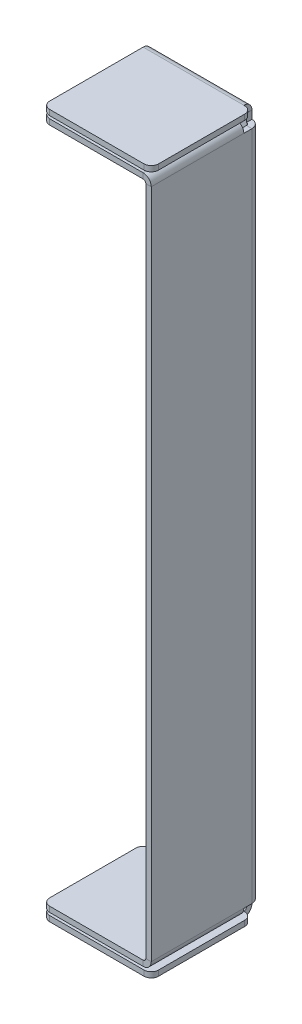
ISO-10303-21;
HEADER;
FILE_DESCRIPTION(('STEP AP214'),'2;1');
FILE_NAME('part.step','',(''),(''),'','','');
FILE_SCHEMA(('AUTOMOTIVE_DESIGN { 1 0 10303 214 1 1 1 1 }'));
ENDSEC;
DATA;
#1=APPLICATION_CONTEXT('core data for automotive mechanical design processes');
#2=APPLICATION_PROTOCOL_DEFINITION('international standard','automotive_design',2000,#1);
#3=PRODUCT_CONTEXT('',#1,'mechanical');
#4=PRODUCT('Part','Part','',(#3));
#5=PRODUCT_RELATED_PRODUCT_CATEGORY('part','',(#4));
#6=PRODUCT_DEFINITION_FORMATION('','',#4);
#7=PRODUCT_DEFINITION_CONTEXT('part definition',#1,'design');
#8=PRODUCT_DEFINITION('design','',#6,#7);
#9=PRODUCT_DEFINITION_SHAPE('','',#8);
#10=(LENGTH_UNIT() NAMED_UNIT(*) SI_UNIT(.MILLI.,.METRE.));
#11=(NAMED_UNIT(*) PLANE_ANGLE_UNIT() SI_UNIT($,.RADIAN.));
#12=(NAMED_UNIT(*) SI_UNIT($,.STERADIAN.) SOLID_ANGLE_UNIT());
#13=UNCERTAINTY_MEASURE_WITH_UNIT(LENGTH_MEASURE(1.E-05),#10,'distance_accuracy_value','');
#14=(GEOMETRIC_REPRESENTATION_CONTEXT(3) GLOBAL_UNCERTAINTY_ASSIGNED_CONTEXT((#13)) GLOBAL_UNIT_ASSIGNED_CONTEXT((#10,
#11,#12)) REPRESENTATION_CONTEXT('',''));
#15=CARTESIAN_POINT('',(0.,0.,0.));
#16=DIRECTION('',(0.,0.,1.));
#17=DIRECTION('',(1.,0.,0.));
#18=AXIS2_PLACEMENT_3D('',#15,#16,#17);
#19=CARTESIAN_POINT('',(12.7634,94.7634,0.7366));
#20=DIRECTION('',(0.,1.,0.));
#21=DIRECTION('',(1.,0.,0.));
#22=AXIS2_PLACEMENT_3D('',#19,#20,#21);
#23=CYLINDRICAL_SURFACE('',#22,2.2366);
#24=DIRECTION('',(0.,1.,0.));
#25=VECTOR('',#24,1.);
#26=CARTESIAN_POINT('',(15.,-94.7634,0.736599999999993));
#27=LINE('',#26,#25);
#28=CARTESIAN_POINT('',(15.,92.5234,0.736599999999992));
#29=VERTEX_POINT('',#28);
#30=CARTESIAN_POINT('',(15.,-92.5234,0.736599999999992));
#31=VERTEX_POINT('',#30);
#32=EDGE_CURVE('E795',#29,#31,#27,.F.);
#33=ORIENTED_EDGE('',*,*,#32,.T.);
#34=CARTESIAN_POINT('',(12.7634,-92.5234,0.7366));
#35=DIRECTION('',(0.,1.,0.));
#36=DIRECTION('',(0.,0.,1.));
#37=AXIS2_PLACEMENT_3D('',#34,#35,#36);
#38=CIRCLE('',#37,2.2366);
#39=CARTESIAN_POINT('',(12.7634,-92.5234,-1.5));
#40=VERTEX_POINT('',#39);
#41=EDGE_CURVE('E456',#31,#40,#38,.T.);
#42=ORIENTED_EDGE('',*,*,#41,.T.);
#43=DIRECTION('',(0.,1.,0.));
#44=VECTOR('',#43,1.);
#45=CARTESIAN_POINT('',(12.7634,94.7634,-1.5));
#46=LINE('',#45,#44);
#47=CARTESIAN_POINT('',(12.7634,92.5234,-1.5));
#48=VERTEX_POINT('',#47);
#49=EDGE_CURVE('E484',#48,#40,#46,.F.);
#50=ORIENTED_EDGE('',*,*,#49,.F.);
#51=CARTESIAN_POINT('',(12.7634,92.5234,0.7366));
#52=DIRECTION('',(0.,-1.,0.));
#53=DIRECTION('',(0.,0.,-1.));
#54=AXIS2_PLACEMENT_3D('',#51,#52,#53);
#55=CIRCLE('',#54,2.2366);
#56=EDGE_CURVE('E827',#48,#29,#55,.T.);
#57=ORIENTED_EDGE('',*,*,#56,.T.);
#58=EDGE_LOOP('',(#33,#42,#50,#57));
#59=FACE_BOUND('',#58,.T.);
#60=ADVANCED_FACE('F141',(#59),#23,.T.);
#61=CARTESIAN_POINT('',(12.7634,94.7634,0.7366));
#62=DIRECTION('',(0.,1.,0.));
#63=DIRECTION('',(1.,0.,0.));
#64=AXIS2_PLACEMENT_3D('',#61,#62,#63);
#65=CYLINDRICAL_SURFACE('',#64,0.7366);
#66=CARTESIAN_POINT('',(12.7634,-92.5234,0.7366));
#67=DIRECTION('',(0.,-1.,0.));
#68=DIRECTION('',(0.,0.,1.));
#69=AXIS2_PLACEMENT_3D('',#66,#67,#68);
#70=CIRCLE('',#69,0.736599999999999);
#71=CARTESIAN_POINT('',(12.7634,-92.5234,0.));
#72=VERTEX_POINT('',#71);
#73=CARTESIAN_POINT('',(13.5,-92.5234,0.736599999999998));
#74=VERTEX_POINT('',#73);
#75=EDGE_CURVE('E457',#72,#74,#70,.T.);
#76=ORIENTED_EDGE('',*,*,#75,.T.);
#77=DIRECTION('',(0.,1.,0.));
#78=VECTOR('',#77,1.);
#79=CARTESIAN_POINT('',(13.5,-94.7634,0.736599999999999));
#80=LINE('',#79,#78);
#81=CARTESIAN_POINT('',(13.5,92.5234,0.736599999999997));
#82=VERTEX_POINT('',#81);
#83=EDGE_CURVE('E790',#74,#82,#80,.T.);
#84=ORIENTED_EDGE('',*,*,#83,.T.);
#85=CARTESIAN_POINT('',(12.7634,92.5234,0.7366));
#86=DIRECTION('',(0.,-1.,0.));
#87=DIRECTION('',(0.,0.,-1.));
#88=AXIS2_PLACEMENT_3D('',#85,#86,#87);
#89=CIRCLE('',#88,0.7366);
#90=CARTESIAN_POINT('',(12.7634,92.5234,0.));
#91=VERTEX_POINT('',#90);
#92=EDGE_CURVE('E480',#91,#82,#89,.T.);
#93=ORIENTED_EDGE('',*,*,#92,.F.);
#94=DIRECTION('',(0.,1.,0.));
#95=VECTOR('',#94,1.);
#96=CARTESIAN_POINT('',(12.7634,94.7634,0.));
#97=LINE('',#96,#95);
#98=EDGE_CURVE('E472',#91,#72,#97,.F.);
#99=ORIENTED_EDGE('',*,*,#98,.T.);
#100=EDGE_LOOP('',(#76,#84,#93,#99));
#101=FACE_BOUND('',#100,.T.);
#102=ADVANCED_FACE('F478',(#101),#65,.F.);
#103=CARTESIAN_POINT('',(15.,-94.7634,0.736600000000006));
#104=DIRECTION('',(1.,0.,0.));
#105=DIRECTION('',(0.,-1.,0.));
#106=AXIS2_PLACEMENT_3D('',#103,#104,#105);
#107=CYLINDRICAL_SURFACE('',#106,2.2366);
#108=DIRECTION('',(1.,0.,0.));
#109=VECTOR('',#108,1.);
#110=CARTESIAN_POINT('',(15.,-94.7634,-1.5));
#111=LINE('',#110,#109);
#112=CARTESIAN_POINT('',(12.76,-94.7634,-1.5));
#113=VERTEX_POINT('',#112);
#114=CARTESIAN_POINT('',(-15.,-94.7634,-1.5));
#115=VERTEX_POINT('',#114);
#116=EDGE_CURVE('E518',#113,#115,#111,.F.);
#117=ORIENTED_EDGE('',*,*,#116,.F.);
#118=CARTESIAN_POINT('',(12.76,-94.7634,0.736600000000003));
#119=DIRECTION('',(-1.,0.,0.));
#120=DIRECTION('',(0.,0.,1.));
#121=AXIS2_PLACEMENT_3D('',#118,#119,#120);
#122=CIRCLE('',#121,2.2366);
#123=CARTESIAN_POINT('',(12.76,-97.,0.736600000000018));
#124=VERTEX_POINT('',#123);
#125=EDGE_CURVE('E1009',#113,#124,#122,.T.);
#126=ORIENTED_EDGE('',*,*,#125,.T.);
#127=DIRECTION('',(1.,0.,0.));
#128=VECTOR('',#127,1.);
#129=CARTESIAN_POINT('',(-15.,-97.,0.736599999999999));
#130=LINE('',#129,#128);
#131=CARTESIAN_POINT('',(-15.,-97.,0.736599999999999));
#132=VERTEX_POINT('',#131);
#133=EDGE_CURVE('E511',#124,#132,#130,.F.);
#134=ORIENTED_EDGE('',*,*,#133,.T.);
#135=CARTESIAN_POINT('',(-15.,-94.7634,0.736600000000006));
#136=DIRECTION('',(1.,0.,0.));
#137=DIRECTION('',(0.,0.,-1.));
#138=AXIS2_PLACEMENT_3D('',#135,#136,#137);
#139=CIRCLE('',#138,2.2366);
#140=EDGE_CURVE('E522',#115,#132,#139,.F.);
#141=ORIENTED_EDGE('',*,*,#140,.F.);
#142=EDGE_LOOP('',(#117,#126,#134,#141));
#143=FACE_BOUND('',#142,.T.);
#144=ADVANCED_FACE('F895',(#143),#107,.T.);
#145=CARTESIAN_POINT('',(15.,-94.7634,0.736600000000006));
#146=DIRECTION('',(1.,0.,0.));
#147=DIRECTION('',(0.,-1.,0.));
#148=AXIS2_PLACEMENT_3D('',#145,#146,#147);
#149=CYLINDRICAL_SURFACE('',#148,0.736600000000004);
#150=CARTESIAN_POINT('',(12.76,-94.7634,0.736600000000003));
#151=DIRECTION('',(-1.,0.,0.));
#152=DIRECTION('',(0.,0.,1.));
#153=AXIS2_PLACEMENT_3D('',#150,#151,#152);
#154=CIRCLE('',#153,0.7366);
#155=CARTESIAN_POINT('',(12.76,-94.7634,0.));
#156=VERTEX_POINT('',#155);
#157=CARTESIAN_POINT('',(12.76,-95.5,0.736600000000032));
#158=VERTEX_POINT('',#157);
#159=EDGE_CURVE('E1101',#156,#158,#154,.T.);
#160=ORIENTED_EDGE('',*,*,#159,.F.);
#161=DIRECTION('',(1.,0.,0.));
#162=VECTOR('',#161,1.);
#163=CARTESIAN_POINT('',(15.,-94.7634,0.));
#164=LINE('',#163,#162);
#165=CARTESIAN_POINT('',(-15.,-94.7634,0.));
#166=VERTEX_POINT('',#165);
#167=EDGE_CURVE('E495',#156,#166,#164,.F.);
#168=ORIENTED_EDGE('',*,*,#167,.T.);
#169=CARTESIAN_POINT('',(-15.,-94.7634,0.736600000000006));
#170=DIRECTION('',(1.,0.,0.));
#171=DIRECTION('',(0.,0.,-1.));
#172=AXIS2_PLACEMENT_3D('',#169,#170,#171);
#173=CIRCLE('',#172,0.736600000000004);
#174=CARTESIAN_POINT('',(-15.,-95.5,0.736600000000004));
#175=VERTEX_POINT('',#174);
#176=EDGE_CURVE('E521',#166,#175,#173,.F.);
#177=ORIENTED_EDGE('',*,*,#176,.T.);
#178=DIRECTION('',(1.,0.,0.));
#179=VECTOR('',#178,1.);
#180=CARTESIAN_POINT('',(-15.,-95.5,0.736600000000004));
#181=LINE('',#180,#179);
#182=EDGE_CURVE('E512',#175,#158,#181,.T.);
#183=ORIENTED_EDGE('',*,*,#182,.T.);
#184=EDGE_LOOP('',(#160,#168,#177,#183));
#185=FACE_BOUND('',#184,.T.);
#186=ADVANCED_FACE('F925',(#185),#149,.F.);
#187=CARTESIAN_POINT('',(12.7634,92.5268,0.7366));
#188=DIRECTION('',(0.,0.,-1.));
#189=DIRECTION('',(0.,1.,0.));
#190=AXIS2_PLACEMENT_3D('',#187,#188,#189);
#191=CYLINDRICAL_SURFACE('',#190,2.2366);
#192=DIRECTION('',(0.,0.,-1.));
#193=VECTOR('',#192,1.);
#194=CARTESIAN_POINT('',(15.,92.5268,0.736599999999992));
#195=LINE('',#194,#193);
#196=CARTESIAN_POINT('',(15.,92.5268,2.97659999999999));
#197=VERTEX_POINT('',#196);
#198=CARTESIAN_POINT('',(15.0000000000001,92.5268,28.5));
#199=VERTEX_POINT('',#198);
#200=EDGE_CURVE('E780',#197,#199,#195,.F.);
#201=ORIENTED_EDGE('',*,*,#200,.F.);
#202=CARTESIAN_POINT('',(12.7634,92.5268,2.9766));
#203=DIRECTION('',(0.,0.,-1.));
#204=DIRECTION('',(-1.,0.,0.));
#205=AXIS2_PLACEMENT_3D('',#202,#203,#204);
#206=CIRCLE('',#205,2.23660000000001);
#207=CARTESIAN_POINT('',(12.7634,94.7634,2.9766));
#208=VERTEX_POINT('',#207);
#209=EDGE_CURVE('E1021',#208,#197,#206,.T.);
#210=ORIENTED_EDGE('',*,*,#209,.F.);
#211=DIRECTION('',(0.,0.,-1.));
#212=VECTOR('',#211,1.);
#213=CARTESIAN_POINT('',(12.7634000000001,94.7634,28.5000000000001));
#214=LINE('',#213,#212);
#215=CARTESIAN_POINT('',(12.7634000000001,94.7634,28.5));
#216=VERTEX_POINT('',#215);
#217=EDGE_CURVE('E770',#208,#216,#214,.F.);
#218=ORIENTED_EDGE('',*,*,#217,.T.);
#219=CARTESIAN_POINT('',(12.7634000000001,92.5268,28.5));
#220=DIRECTION('',(0.,0.,-1.));
#221=DIRECTION('',(-1.,0.,0.));
#222=AXIS2_PLACEMENT_3D('',#219,#220,#221);
#223=CIRCLE('',#222,2.2366);
#224=EDGE_CURVE('E779',#199,#216,#223,.F.);
#225=ORIENTED_EDGE('',*,*,#224,.F.);
#226=EDGE_LOOP('',(#201,#210,#218,#225));
#227=FACE_BOUND('',#226,.T.);
#228=ADVANCED_FACE('F929',(#227),#191,.T.);
#229=CARTESIAN_POINT('',(12.7634,92.5268,0.7366));
#230=DIRECTION('',(0.,0.,-1.));
#231=DIRECTION('',(0.,1.,0.));
#232=AXIS2_PLACEMENT_3D('',#229,#230,#231);
#233=CYLINDRICAL_SURFACE('',#232,0.736600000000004);
#234=CARTESIAN_POINT('',(12.7634,92.5268,2.9766));
#235=DIRECTION('',(0.,0.,-1.));
#236=DIRECTION('',(-1.,0.,0.));
#237=AXIS2_PLACEMENT_3D('',#234,#235,#236);
#238=CIRCLE('',#237,0.736600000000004);
#239=CARTESIAN_POINT('',(12.7634,93.2634,2.9766));
#240=VERTEX_POINT('',#239);
#241=CARTESIAN_POINT('',(13.5,92.5268,2.9766));
#242=VERTEX_POINT('',#241);
#243=EDGE_CURVE('E1017',#240,#242,#238,.T.);
#244=ORIENTED_EDGE('',*,*,#243,.T.);
#245=DIRECTION('',(0.,0.,-1.));
#246=VECTOR('',#245,1.);
#247=CARTESIAN_POINT('',(13.5,92.5268,0.736599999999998));
#248=LINE('',#247,#246);
#249=CARTESIAN_POINT('',(13.5000000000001,92.5268,28.5));
#250=VERTEX_POINT('',#249);
#251=EDGE_CURVE('E753',#242,#250,#248,.F.);
#252=ORIENTED_EDGE('',*,*,#251,.T.);
#253=CARTESIAN_POINT('',(12.7634000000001,92.5268,28.5));
#254=DIRECTION('',(0.,0.,-1.));
#255=DIRECTION('',(-1.,0.,0.));
#256=AXIS2_PLACEMENT_3D('',#253,#254,#255);
#257=CIRCLE('',#256,0.736600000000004);
#258=CARTESIAN_POINT('',(12.7634000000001,93.2634,28.5));
#259=VERTEX_POINT('',#258);
#260=EDGE_CURVE('E784',#250,#259,#257,.F.);
#261=ORIENTED_EDGE('',*,*,#260,.T.);
#262=DIRECTION('',(0.,0.,-1.));
#263=VECTOR('',#262,1.);
#264=CARTESIAN_POINT('',(12.7634000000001,93.2634,28.5000000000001));
#265=LINE('',#264,#263);
#266=EDGE_CURVE('E771',#259,#240,#265,.T.);
#267=ORIENTED_EDGE('',*,*,#266,.T.);
#268=EDGE_LOOP('',(#244,#252,#261,#267));
#269=FACE_BOUND('',#268,.T.);
#270=ADVANCED_FACE('F1127',(#269),#233,.F.);
#271=CARTESIAN_POINT('',(12.7634000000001,-92.5268,28.5));
#272=DIRECTION('',(0.,0.,1.));
#273=DIRECTION('',(0.,-1.,0.));
#274=AXIS2_PLACEMENT_3D('',#271,#272,#273);
#275=CYLINDRICAL_SURFACE('',#274,2.2366);
#276=DIRECTION('',(0.,0.,1.));
#277=VECTOR('',#276,1.);
#278=CARTESIAN_POINT('',(12.7634,-94.7634,0.736600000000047));
#279=LINE('',#278,#277);
#280=CARTESIAN_POINT('',(12.7634000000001,-94.7634,28.5));
#281=VERTEX_POINT('',#280);
#282=CARTESIAN_POINT('',(12.7634,-94.7634,2.9766));
#283=VERTEX_POINT('',#282);
#284=EDGE_CURVE('E734',#281,#283,#279,.F.);
#285=ORIENTED_EDGE('',*,*,#284,.T.);
#286=CARTESIAN_POINT('',(12.7634,-92.5268,2.9766));
#287=DIRECTION('',(0.,0.,-1.));
#288=DIRECTION('',(-1.,0.,0.));
#289=AXIS2_PLACEMENT_3D('',#286,#287,#288);
#290=CIRCLE('',#289,2.23660000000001);
#291=CARTESIAN_POINT('',(15.,-92.5268,2.97659999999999));
#292=VERTEX_POINT('',#291);
#293=EDGE_CURVE('E1008',#292,#283,#290,.T.);
#294=ORIENTED_EDGE('',*,*,#293,.F.);
#295=DIRECTION('',(0.,0.,1.));
#296=VECTOR('',#295,1.);
#297=CARTESIAN_POINT('',(15.0000000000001,-92.5268,28.5));
#298=LINE('',#297,#296);
#299=CARTESIAN_POINT('',(15.0000000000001,-92.5268,28.5));
#300=VERTEX_POINT('',#299);
#301=EDGE_CURVE('E739',#300,#292,#298,.F.);
#302=ORIENTED_EDGE('',*,*,#301,.F.);
#303=CARTESIAN_POINT('',(12.7634000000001,-92.5268,28.5));
#304=DIRECTION('',(0.,0.,1.));
#305=DIRECTION('',(1.,0.,0.));
#306=AXIS2_PLACEMENT_3D('',#303,#304,#305);
#307=CIRCLE('',#306,2.2366);
#308=EDGE_CURVE('E743',#281,#300,#307,.T.);
#309=ORIENTED_EDGE('',*,*,#308,.F.);
#310=EDGE_LOOP('',(#285,#294,#302,#309));
#311=FACE_BOUND('',#310,.T.);
#312=ADVANCED_FACE('F1117',(#311),#275,.T.);
#313=CARTESIAN_POINT('',(12.7634000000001,-92.5268,28.5));
#314=DIRECTION('',(0.,0.,1.));
#315=DIRECTION('',(0.,-1.,0.));
#316=AXIS2_PLACEMENT_3D('',#313,#314,#315);
#317=CYLINDRICAL_SURFACE('',#316,0.736600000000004);
#318=CARTESIAN_POINT('',(12.7634,-92.5268,2.9766));
#319=DIRECTION('',(0.,0.,1.));
#320=DIRECTION('',(1.,0.,0.));
#321=AXIS2_PLACEMENT_3D('',#318,#319,#320);
#322=CIRCLE('',#321,0.736600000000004);
#323=CARTESIAN_POINT('',(13.5,-92.5268,2.9766));
#324=VERTEX_POINT('',#323);
#325=CARTESIAN_POINT('',(12.7634,-93.2634,2.9766));
#326=VERTEX_POINT('',#325);
#327=EDGE_CURVE('E856',#324,#326,#322,.F.);
#328=ORIENTED_EDGE('',*,*,#327,.T.);
#329=DIRECTION('',(0.,0.,1.));
#330=VECTOR('',#329,1.);
#331=CARTESIAN_POINT('',(12.7634,-93.2634,0.736600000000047));
#332=LINE('',#331,#330);
#333=CARTESIAN_POINT('',(12.7634000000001,-93.2634,28.5));
#334=VERTEX_POINT('',#333);
#335=EDGE_CURVE('E697',#326,#334,#332,.T.);
#336=ORIENTED_EDGE('',*,*,#335,.T.);
#337=CARTESIAN_POINT('',(12.7634000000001,-92.5268,28.5));
#338=DIRECTION('',(0.,0.,1.));
#339=DIRECTION('',(1.,0.,0.));
#340=AXIS2_PLACEMENT_3D('',#337,#338,#339);
#341=CIRCLE('',#340,0.736600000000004);
#342=CARTESIAN_POINT('',(13.5000000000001,-92.5268,28.5));
#343=VERTEX_POINT('',#342);
#344=EDGE_CURVE('E714',#334,#343,#341,.T.);
#345=ORIENTED_EDGE('',*,*,#344,.T.);
#346=DIRECTION('',(0.,0.,1.));
#347=VECTOR('',#346,1.);
#348=CARTESIAN_POINT('',(13.5000000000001,-92.5268,28.5));
#349=LINE('',#348,#347);
#350=EDGE_CURVE('E718',#343,#324,#349,.F.);
#351=ORIENTED_EDGE('',*,*,#350,.T.);
#352=EDGE_LOOP('',(#328,#336,#345,#351));
#353=FACE_BOUND('',#352,.T.);
#354=ADVANCED_FACE('F855',(#353),#317,.F.);
#355=CARTESIAN_POINT('',(-15.,94.7634,0.736600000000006));
#356=DIRECTION('',(-1.,0.,0.));
#357=DIRECTION('',(0.,1.,0.));
#358=AXIS2_PLACEMENT_3D('',#355,#356,#357);
#359=CYLINDRICAL_SURFACE('',#358,2.2366);
#360=DIRECTION('',(-1.,0.,0.));
#361=VECTOR('',#360,1.);
#362=CARTESIAN_POINT('',(15.,97.,0.736599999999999));
#363=LINE('',#362,#361);
#364=CARTESIAN_POINT('',(-15.,97.,0.736599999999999));
#365=VERTEX_POINT('',#364);
#366=CARTESIAN_POINT('',(12.76,97.,0.736599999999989));
#367=VERTEX_POINT('',#366);
#368=EDGE_CURVE('E550',#365,#367,#363,.F.);
#369=ORIENTED_EDGE('',*,*,#368,.T.);
#370=CARTESIAN_POINT('',(12.76,94.7634,0.736600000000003));
#371=DIRECTION('',(-1.,0.,0.));
#372=DIRECTION('',(0.,0.,1.));
#373=AXIS2_PLACEMENT_3D('',#370,#371,#372);
#374=CIRCLE('',#373,2.2366);
#375=CARTESIAN_POINT('',(12.76,94.7634,-1.5));
#376=VERTEX_POINT('',#375);
#377=EDGE_CURVE('E844',#367,#376,#374,.T.);
#378=ORIENTED_EDGE('',*,*,#377,.T.);
#379=DIRECTION('',(-1.,0.,0.));
#380=VECTOR('',#379,1.);
#381=CARTESIAN_POINT('',(-15.,94.7634,-1.5));
#382=LINE('',#381,#380);
#383=CARTESIAN_POINT('',(-15.,94.7634,-1.5));
#384=VERTEX_POINT('',#383);
#385=EDGE_CURVE('E558',#384,#376,#382,.F.);
#386=ORIENTED_EDGE('',*,*,#385,.F.);
#387=CARTESIAN_POINT('',(-15.,94.7634,0.736600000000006));
#388=DIRECTION('',(-1.,0.,0.));
#389=DIRECTION('',(0.,0.,1.));
#390=AXIS2_PLACEMENT_3D('',#387,#388,#389);
#391=CIRCLE('',#390,2.2366);
#392=EDGE_CURVE('E562',#365,#384,#391,.T.);
#393=ORIENTED_EDGE('',*,*,#392,.F.);
#394=EDGE_LOOP('',(#369,#378,#386,#393));
#395=FACE_BOUND('',#394,.T.);
#396=ADVANCED_FACE('F954',(#395),#359,.T.);
#397=CARTESIAN_POINT('',(-15.,94.7634,0.736600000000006));
#398=DIRECTION('',(-1.,0.,0.));
#399=DIRECTION('',(0.,1.,0.));
#400=AXIS2_PLACEMENT_3D('',#397,#398,#399);
#401=CYLINDRICAL_SURFACE('',#400,0.736600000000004);
#402=CARTESIAN_POINT('',(12.76,94.7634,0.736600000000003));
#403=DIRECTION('',(1.,0.,0.));
#404=DIRECTION('',(0.,0.,-1.));
#405=AXIS2_PLACEMENT_3D('',#402,#403,#404);
#406=CIRCLE('',#405,0.7366);
#407=CARTESIAN_POINT('',(12.76,95.5,0.736600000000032));
#408=VERTEX_POINT('',#407);
#409=CARTESIAN_POINT('',(12.76,94.7634,0.));
#410=VERTEX_POINT('',#409);
#411=EDGE_CURVE('E841',#408,#410,#406,.F.);
#412=ORIENTED_EDGE('',*,*,#411,.F.);
#413=DIRECTION('',(-1.,0.,0.));
#414=VECTOR('',#413,1.);
#415=CARTESIAN_POINT('',(15.,95.5,0.736600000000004));
#416=LINE('',#415,#414);
#417=CARTESIAN_POINT('',(-15.,95.5,0.736600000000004));
#418=VERTEX_POINT('',#417);
#419=EDGE_CURVE('E531',#408,#418,#416,.T.);
#420=ORIENTED_EDGE('',*,*,#419,.T.);
#421=CARTESIAN_POINT('',(-15.,94.7634,0.736600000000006));
#422=DIRECTION('',(-1.,0.,0.));
#423=DIRECTION('',(0.,0.,1.));
#424=AXIS2_PLACEMENT_3D('',#421,#422,#423);
#425=CIRCLE('',#424,0.736600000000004);
#426=CARTESIAN_POINT('',(-15.,94.7634,0.));
#427=VERTEX_POINT('',#426);
#428=EDGE_CURVE('E535',#418,#427,#425,.T.);
#429=ORIENTED_EDGE('',*,*,#428,.T.);
#430=DIRECTION('',(-1.,0.,0.));
#431=VECTOR('',#430,1.);
#432=CARTESIAN_POINT('',(-15.,94.7634,0.));
#433=LINE('',#432,#431);
#434=EDGE_CURVE('E565',#427,#410,#433,.F.);
#435=ORIENTED_EDGE('',*,*,#434,.T.);
#436=EDGE_LOOP('',(#412,#420,#429,#435));
#437=FACE_BOUND('',#436,.T.);
#438=ADVANCED_FACE('F957',(#437),#401,.F.);
#439=CARTESIAN_POINT('',(15.,0.,0.));
#440=DIRECTION('',(-1.,0.,0.));
#441=DIRECTION('',(0.,0.,1.));
#442=AXIS2_PLACEMENT_3D('',#439,#440,#441);
#443=PLANE('',#442);
#444=ORIENTED_EDGE('',*,*,#301,.T.);
#445=DIRECTION('',(0.,0.,-1.));
#446=VECTOR('',#445,1.);
#447=CARTESIAN_POINT('',(15.,-92.5268,2.97659999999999));
#448=LINE('',#447,#446);
#449=CARTESIAN_POINT('',(15.,-92.5268,0.736599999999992));
#450=VERTEX_POINT('',#449);
#451=EDGE_CURVE('E1031',#292,#450,#448,.T.);
#452=ORIENTED_EDGE('',*,*,#451,.T.);
#453=DIRECTION('',(0.,-1.,0.));
#454=VECTOR('',#453,1.);
#455=CARTESIAN_POINT('',(15.,-92.5234,0.736599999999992));
#456=LINE('',#455,#454);
#457=EDGE_CURVE('E1050',#31,#450,#456,.T.);
#458=ORIENTED_EDGE('',*,*,#457,.F.);
#459=ORIENTED_EDGE('',*,*,#32,.F.);
#460=CARTESIAN_POINT('',(15.,92.5268,0.736599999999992));
#461=VERTEX_POINT('',#460);
#462=EDGE_CURVE('E794',#461,#29,#27,.F.);
#463=ORIENTED_EDGE('',*,*,#462,.F.);
#464=EDGE_CURVE('E776',#461,#197,#195,.F.);
#465=ORIENTED_EDGE('',*,*,#464,.T.);
#466=ORIENTED_EDGE('',*,*,#200,.T.);
#467=DIRECTION('',(0.,-1.,0.));
#468=VECTOR('',#467,1.);
#469=CARTESIAN_POINT('',(15.0000000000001,0.,28.5));
#470=LINE('',#469,#468);
#471=EDGE_CURVE('E482',#199,#300,#470,.T.);
#472=ORIENTED_EDGE('',*,*,#471,.T.);
#473=EDGE_LOOP('',(#444,#452,#458,#459,#463,#465,#466,#472));
#474=FACE_BOUND('',#473,.T.);
#475=ADVANCED_FACE('F961',(#474),#443,.F.);
#476=CARTESIAN_POINT('',(13.5,0.,0.));
#477=DIRECTION('',(-1.,0.,0.));
#478=DIRECTION('',(0.,0.,1.));
#479=AXIS2_PLACEMENT_3D('',#476,#477,#478);
#480=PLANE('',#479);
#481=CARTESIAN_POINT('',(13.5,-92.5268,0.736599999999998));
#482=VERTEX_POINT('',#481);
#483=EDGE_CURVE('E797',#482,#74,#80,.T.);
#484=ORIENTED_EDGE('',*,*,#483,.F.);
#485=DIRECTION('',(0.,0.,1.));
#486=VECTOR('',#485,1.);
#487=CARTESIAN_POINT('',(13.5000000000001,-92.5268,28.5));
#488=LINE('',#487,#486);
#489=EDGE_CURVE('E808',#324,#482,#488,.F.);
#490=ORIENTED_EDGE('',*,*,#489,.F.);
#491=ORIENTED_EDGE('',*,*,#350,.F.);
#492=DIRECTION('',(0.,1.,0.));
#493=VECTOR('',#492,1.);
#494=CARTESIAN_POINT('',(13.5000000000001,-94.7634,28.5));
#495=LINE('',#494,#493);
#496=EDGE_CURVE('E486',#250,#343,#495,.F.);
#497=ORIENTED_EDGE('',*,*,#496,.F.);
#498=ORIENTED_EDGE('',*,*,#251,.F.);
#499=CARTESIAN_POINT('',(13.5,92.5268,0.736599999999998));
#500=VERTEX_POINT('',#499);
#501=EDGE_CURVE('E787',#500,#242,#248,.F.);
#502=ORIENTED_EDGE('',*,*,#501,.F.);
#503=DIRECTION('',(0.,1.,0.));
#504=VECTOR('',#503,1.);
#505=CARTESIAN_POINT('',(13.5,94.7634,0.736600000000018));
#506=LINE('',#505,#504);
#507=EDGE_CURVE('E812',#500,#82,#506,.F.);
#508=ORIENTED_EDGE('',*,*,#507,.T.);
#509=ORIENTED_EDGE('',*,*,#83,.F.);
#510=EDGE_LOOP('',(#484,#490,#491,#497,#498,#502,#508,#509));
#511=FACE_BOUND('',#510,.T.);
#512=ADVANCED_FACE('F806',(#511),#480,.T.);
#513=CARTESIAN_POINT('',(15.0000000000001,-94.7634,28.5));
#514=DIRECTION('',(0.,0.,-1.));
#515=DIRECTION('',(-1.,0.,0.));
#516=AXIS2_PLACEMENT_3D('',#513,#514,#515);
#517=PLANE('',#516);
#518=DIRECTION('',(1.,0.,0.));
#519=VECTOR('',#518,1.);
#520=CARTESIAN_POINT('',(13.5000000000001,-92.5268,28.5));
#521=LINE('',#520,#519);
#522=EDGE_CURVE('E742',#343,#300,#521,.T.);
#523=ORIENTED_EDGE('',*,*,#522,.T.);
#524=ORIENTED_EDGE('',*,*,#471,.F.);
#525=DIRECTION('',(1.,0.,0.));
#526=VECTOR('',#525,1.);
#527=CARTESIAN_POINT('',(13.5000000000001,92.5268,28.5));
#528=LINE('',#527,#526);
#529=EDGE_CURVE('E783',#250,#199,#528,.T.);
#530=ORIENTED_EDGE('',*,*,#529,.F.);
#531=ORIENTED_EDGE('',*,*,#496,.T.);
#532=EDGE_LOOP('',(#523,#524,#530,#531));
#533=FACE_BOUND('',#532,.T.);
#534=ADVANCED_FACE('F898',(#533),#517,.F.);
#535=CARTESIAN_POINT('',(0.,0.,-1.5));
#536=DIRECTION('',(0.,0.,-1.));
#537=DIRECTION('',(-1.,0.,0.));
#538=AXIS2_PLACEMENT_3D('',#535,#536,#537);
#539=PLANE('',#538);
#540=ORIENTED_EDGE('',*,*,#385,.T.);
#541=DIRECTION('',(-1.,0.,0.));
#542=VECTOR('',#541,1.);
#543=CARTESIAN_POINT('',(-15.,94.7634,-1.5));
#544=LINE('',#543,#542);
#545=CARTESIAN_POINT('',(12.7634,94.7634,-1.5));
#546=VERTEX_POINT('',#545);
#547=EDGE_CURVE('E838',#376,#546,#544,.F.);
#548=ORIENTED_EDGE('',*,*,#547,.T.);
#549=EDGE_CURVE('E490',#546,#48,#46,.F.);
#550=ORIENTED_EDGE('',*,*,#549,.T.);
#551=ORIENTED_EDGE('',*,*,#49,.T.);
#552=DIRECTION('',(0.,-1.,0.));
#553=VECTOR('',#552,1.);
#554=CARTESIAN_POINT('',(12.7634,-92.5234,-1.5));
#555=LINE('',#554,#553);
#556=CARTESIAN_POINT('',(12.7634,-94.7634,-1.5));
#557=VERTEX_POINT('',#556);
#558=EDGE_CURVE('E452',#40,#557,#555,.T.);
#559=ORIENTED_EDGE('',*,*,#558,.T.);
#560=EDGE_CURVE('E520',#557,#113,#111,.F.);
#561=ORIENTED_EDGE('',*,*,#560,.T.);
#562=ORIENTED_EDGE('',*,*,#116,.T.);
#563=DIRECTION('',(0.,-1.,0.));
#564=VECTOR('',#563,1.);
#565=CARTESIAN_POINT('',(-15.,-97.,-1.5));
#566=LINE('',#565,#564);
#567=EDGE_CURVE('E573',#384,#115,#566,.T.);
#568=ORIENTED_EDGE('',*,*,#567,.F.);
#569=EDGE_LOOP('',(#540,#548,#550,#551,#559,#561,#562,#568));
#570=FACE_BOUND('',#569,.T.);
#571=ADVANCED_FACE('F967',(#570),#539,.T.);
#572=CARTESIAN_POINT('',(0.,0.,0.));
#573=DIRECTION('',(0.,0.,-1.));
#574=DIRECTION('',(-1.,0.,0.));
#575=AXIS2_PLACEMENT_3D('',#572,#573,#574);
#576=PLANE('',#575);
#577=CARTESIAN_POINT('',(12.7634,94.7634,0.));
#578=VERTEX_POINT('',#577);
#579=EDGE_CURVE('E481',#578,#91,#97,.F.);
#580=ORIENTED_EDGE('',*,*,#579,.F.);
#581=DIRECTION('',(1.,0.,0.));
#582=VECTOR('',#581,1.);
#583=CARTESIAN_POINT('',(12.76,94.7634,0.));
#584=LINE('',#583,#582);
#585=EDGE_CURVE('E832',#410,#578,#584,.T.);
#586=ORIENTED_EDGE('',*,*,#585,.F.);
#587=ORIENTED_EDGE('',*,*,#434,.F.);
#588=DIRECTION('',(0.,-1.,0.));
#589=VECTOR('',#588,1.);
#590=CARTESIAN_POINT('',(-15.,-97.,0.));
#591=LINE('',#590,#589);
#592=EDGE_CURVE('E572',#427,#166,#591,.T.);
#593=ORIENTED_EDGE('',*,*,#592,.T.);
#594=ORIENTED_EDGE('',*,*,#167,.F.);
#595=CARTESIAN_POINT('',(12.7634,-94.7634,0.));
#596=VERTEX_POINT('',#595);
#597=EDGE_CURVE('E475',#596,#156,#164,.F.);
#598=ORIENTED_EDGE('',*,*,#597,.F.);
#599=DIRECTION('',(0.,-1.,0.));
#600=VECTOR('',#599,1.);
#601=CARTESIAN_POINT('',(12.7634,-92.5234,0.));
#602=LINE('',#601,#600);
#603=EDGE_CURVE('E449',#72,#596,#602,.T.);
#604=ORIENTED_EDGE('',*,*,#603,.F.);
#605=ORIENTED_EDGE('',*,*,#98,.F.);
#606=EDGE_LOOP('',(#580,#586,#587,#593,#594,#598,#604,#605));
#607=FACE_BOUND('',#606,.T.);
#608=ADVANCED_FACE('F471',(#607),#576,.F.);
#609=CARTESIAN_POINT('',(-15.,-97.,-1.5));
#610=DIRECTION('',(-1.,0.,0.));
#611=DIRECTION('',(0.,0.,1.));
#612=AXIS2_PLACEMENT_3D('',#609,#610,#611);
#613=PLANE('',#612);
#614=DIRECTION('',(0.,0.,-1.));
#615=VECTOR('',#614,1.);
#616=CARTESIAN_POINT('',(-15.,-94.7634,0.));
#617=LINE('',#616,#615);
#618=EDGE_CURVE('E525',#166,#115,#617,.T.);
#619=ORIENTED_EDGE('',*,*,#618,.F.);
#620=ORIENTED_EDGE('',*,*,#592,.F.);
#621=DIRECTION('',(0.,0.,-1.));
#622=VECTOR('',#621,1.);
#623=CARTESIAN_POINT('',(-15.,94.7634,0.));
#624=LINE('',#623,#622);
#625=EDGE_CURVE('E561',#427,#384,#624,.T.);
#626=ORIENTED_EDGE('',*,*,#625,.T.);
#627=ORIENTED_EDGE('',*,*,#567,.T.);
#628=EDGE_LOOP('',(#619,#620,#626,#627));
#629=FACE_BOUND('',#628,.T.);
#630=ADVANCED_FACE('F965',(#629),#613,.T.);
#631=CARTESIAN_POINT('',(-15.,94.7634,0.736600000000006));
#632=DIRECTION('',(1.,0.,0.));
#633=DIRECTION('',(0.,0.,-1.));
#634=AXIS2_PLACEMENT_3D('',#631,#632,#633);
#635=PLANE('',#634);
#636=ORIENTED_EDGE('',*,*,#428,.F.);
#637=DIRECTION('',(0.,-1.,0.));
#638=VECTOR('',#637,1.);
#639=CARTESIAN_POINT('',(-15.,95.5,0.736600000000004));
#640=LINE('',#639,#638);
#641=EDGE_CURVE('E553',#418,#365,#640,.F.);
#642=ORIENTED_EDGE('',*,*,#641,.T.);
#643=ORIENTED_EDGE('',*,*,#392,.T.);
#644=ORIENTED_EDGE('',*,*,#625,.F.);
#645=EDGE_LOOP('',(#636,#642,#643,#644));
#646=FACE_BOUND('',#645,.T.);
#647=ADVANCED_FACE('F952',(#646),#635,.F.);
#648=CARTESIAN_POINT('',(15.,97.,0.));
#649=DIRECTION('',(-1.,0.,0.));
#650=DIRECTION('',(0.,0.,1.));
#651=AXIS2_PLACEMENT_3D('',#648,#649,#650);
#652=PLANE('',#651);
#653=DIRECTION('',(0.,0.,-1.));
#654=VECTOR('',#653,1.);
#655=CARTESIAN_POINT('',(15.,97.,-3.35869429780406E-13));
#656=LINE('',#655,#654);
#657=CARTESIAN_POINT('',(15.,97.0000000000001,26.5));
#658=VERTEX_POINT('',#657);
#659=CARTESIAN_POINT('',(15.,97.,2.73660000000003));
#660=VERTEX_POINT('',#659);
#661=EDGE_CURVE('E539',#658,#660,#656,.T.);
#662=ORIENTED_EDGE('',*,*,#661,.F.);
#663=DIRECTION('',(0.,-1.,0.));
#664=VECTOR('',#663,1.);
#665=CARTESIAN_POINT('',(15.,97.0000000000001,26.5));
#666=LINE('',#665,#664);
#667=CARTESIAN_POINT('',(15.,95.5000000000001,26.5));
#668=VERTEX_POINT('',#667);
#669=EDGE_CURVE('E671',#658,#668,#666,.T.);
#670=ORIENTED_EDGE('',*,*,#669,.T.);
#671=DIRECTION('',(0.,0.,1.));
#672=VECTOR('',#671,1.);
#673=CARTESIAN_POINT('',(15.,95.5,0.));
#674=LINE('',#673,#672);
#675=CARTESIAN_POINT('',(15.,95.5,2.73660000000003));
#676=VERTEX_POINT('',#675);
#677=EDGE_CURVE('E547',#668,#676,#674,.F.);
#678=ORIENTED_EDGE('',*,*,#677,.T.);
#679=DIRECTION('',(0.,1.,0.));
#680=VECTOR('',#679,1.);
#681=CARTESIAN_POINT('',(15.,97.,2.73660000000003));
#682=LINE('',#681,#680);
#683=EDGE_CURVE('E669',#676,#660,#682,.T.);
#684=ORIENTED_EDGE('',*,*,#683,.T.);
#685=EDGE_LOOP('',(#662,#670,#678,#684));
#686=FACE_BOUND('',#685,.T.);
#687=ADVANCED_FACE('F948',(#686),#652,.F.);
#688=CARTESIAN_POINT('',(-15.,97.0000000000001,28.5));
#689=DIRECTION('',(1.,0.,0.));
#690=DIRECTION('',(0.,0.,-1.));
#691=AXIS2_PLACEMENT_3D('',#688,#689,#690);
#692=PLANE('',#691);
#693=DIRECTION('',(0.,0.,-1.));
#694=VECTOR('',#693,1.);
#695=CARTESIAN_POINT('',(-15.,95.5000000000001,28.5));
#696=LINE('',#695,#694);
#697=CARTESIAN_POINT('',(-15.,95.5000000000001,26.5));
#698=VERTEX_POINT('',#697);
#699=EDGE_CURVE('E544',#418,#698,#696,.F.);
#700=ORIENTED_EDGE('',*,*,#699,.T.);
#701=DIRECTION('',(0.,-1.,0.));
#702=VECTOR('',#701,1.);
#703=CARTESIAN_POINT('',(-15.,97.0000000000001,26.5));
#704=LINE('',#703,#702);
#705=CARTESIAN_POINT('',(-15.,97.0000000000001,26.5));
#706=VERTEX_POINT('',#705);
#707=EDGE_CURVE('E662',#698,#706,#704,.F.);
#708=ORIENTED_EDGE('',*,*,#707,.T.);
#709=DIRECTION('',(0.,0.,1.));
#710=VECTOR('',#709,1.);
#711=CARTESIAN_POINT('',(-15.,97.,-3.35869429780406E-13));
#712=LINE('',#711,#710);
#713=EDGE_CURVE('E536',#365,#706,#712,.T.);
#714=ORIENTED_EDGE('',*,*,#713,.F.);
#715=ORIENTED_EDGE('',*,*,#641,.F.);
#716=EDGE_LOOP('',(#700,#708,#714,#715));
#717=FACE_BOUND('',#716,.T.);
#718=ADVANCED_FACE('F939',(#717),#692,.F.);
#719=CARTESIAN_POINT('',(0.,97.,-3.35869429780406E-13));
#720=DIRECTION('',(0.,-1.,0.));
#721=DIRECTION('',(0.,0.,-1.));
#722=AXIS2_PLACEMENT_3D('',#719,#720,#721);
#723=PLANE('',#722);
#724=ORIENTED_EDGE('',*,*,#713,.T.);
#725=CARTESIAN_POINT('',(-13.,97.0000000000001,26.5));
#726=DIRECTION('',(0.,-1.,0.));
#727=DIRECTION('',(0.,0.,-1.));
#728=AXIS2_PLACEMENT_3D('',#725,#726,#727);
#729=CIRCLE('',#728,2.);
#730=CARTESIAN_POINT('',(-13.,97.0000000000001,28.5));
#731=VERTEX_POINT('',#730);
#732=EDGE_CURVE('E667',#706,#731,#729,.F.);
#733=ORIENTED_EDGE('',*,*,#732,.T.);
#734=DIRECTION('',(1.,0.,0.));
#735=VECTOR('',#734,1.);
#736=CARTESIAN_POINT('',(0.,97.0000000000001,28.5));
#737=LINE('',#736,#735);
#738=CARTESIAN_POINT('',(13.,97.0000000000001,28.5));
#739=VERTEX_POINT('',#738);
#740=EDGE_CURVE('E532',#731,#739,#737,.T.);
#741=ORIENTED_EDGE('',*,*,#740,.T.);
#742=CARTESIAN_POINT('',(13.,97.0000000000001,26.5));
#743=DIRECTION('',(0.,-1.,0.));
#744=DIRECTION('',(0.,0.,-1.));
#745=AXIS2_PLACEMENT_3D('',#742,#743,#744);
#746=CIRCLE('',#745,2.);
#747=EDGE_CURVE('E665',#739,#658,#746,.F.);
#748=ORIENTED_EDGE('',*,*,#747,.T.);
#749=ORIENTED_EDGE('',*,*,#661,.T.);
#750=CARTESIAN_POINT('',(13.,97.,2.73660000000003));
#751=DIRECTION('',(0.,-1.,0.));
#752=DIRECTION('',(0.,0.,-1.));
#753=AXIS2_PLACEMENT_3D('',#750,#751,#752);
#754=CIRCLE('',#753,2.);
#755=CARTESIAN_POINT('',(13.,97.,0.736600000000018));
#756=VERTEX_POINT('',#755);
#757=EDGE_CURVE('E156',#660,#756,#754,.F.);
#758=ORIENTED_EDGE('',*,*,#757,.T.);
#759=DIRECTION('',(-1.,0.,0.));
#760=VECTOR('',#759,1.);
#761=CARTESIAN_POINT('',(-15.,97.,0.736600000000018));
#762=LINE('',#761,#760);
#763=EDGE_CURVE('E723',#756,#367,#762,.T.);
#764=ORIENTED_EDGE('',*,*,#763,.T.);
#765=ORIENTED_EDGE('',*,*,#368,.F.);
#766=EDGE_LOOP('',(#724,#733,#741,#748,#749,#758,#764,#765));
#767=FACE_BOUND('',#766,.T.);
#768=ADVANCED_FACE('F935',(#767),#723,.F.);
#769=CARTESIAN_POINT('',(0.,95.5,-3.30632207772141E-13));
#770=DIRECTION('',(0.,-1.,0.));
#771=DIRECTION('',(0.,0.,-1.));
#772=AXIS2_PLACEMENT_3D('',#769,#770,#771);
#773=PLANE('',#772);
#774=DIRECTION('',(-1.,0.,0.));
#775=VECTOR('',#774,1.);
#776=CARTESIAN_POINT('',(15.,95.5000000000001,28.5));
#777=LINE('',#776,#775);
#778=CARTESIAN_POINT('',(-13.,95.5000000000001,28.5));
#779=VERTEX_POINT('',#778);
#780=CARTESIAN_POINT('',(13.,95.5000000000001,28.5));
#781=VERTEX_POINT('',#780);
#782=EDGE_CURVE('E541',#779,#781,#777,.F.);
#783=ORIENTED_EDGE('',*,*,#782,.F.);
#784=CARTESIAN_POINT('',(-13.,95.5000000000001,26.5));
#785=DIRECTION('',(0.,-1.,0.));
#786=DIRECTION('',(0.,0.,-1.));
#787=AXIS2_PLACEMENT_3D('',#784,#785,#786);
#788=CIRCLE('',#787,2.);
#789=EDGE_CURVE('E660',#779,#698,#788,.T.);
#790=ORIENTED_EDGE('',*,*,#789,.T.);
#791=ORIENTED_EDGE('',*,*,#699,.F.);
#792=ORIENTED_EDGE('',*,*,#419,.F.);
#793=CARTESIAN_POINT('',(13.,95.5,0.736600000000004));
#794=VERTEX_POINT('',#793);
#795=EDGE_CURVE('E556',#794,#408,#416,.T.);
#796=ORIENTED_EDGE('',*,*,#795,.F.);
#797=CARTESIAN_POINT('',(13.,95.5,2.73660000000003));
#798=DIRECTION('',(0.,-1.,0.));
#799=DIRECTION('',(0.,0.,-1.));
#800=AXIS2_PLACEMENT_3D('',#797,#798,#799);
#801=CIRCLE('',#800,2.);
#802=EDGE_CURVE('E656',#794,#676,#801,.T.);
#803=ORIENTED_EDGE('',*,*,#802,.T.);
#804=ORIENTED_EDGE('',*,*,#677,.F.);
#805=CARTESIAN_POINT('',(13.,95.5000000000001,26.5));
#806=DIRECTION('',(0.,-1.,0.));
#807=DIRECTION('',(0.,0.,-1.));
#808=AXIS2_PLACEMENT_3D('',#805,#806,#807);
#809=CIRCLE('',#808,2.);
#810=EDGE_CURVE('E658',#668,#781,#809,.T.);
#811=ORIENTED_EDGE('',*,*,#810,.T.);
#812=EDGE_LOOP('',(#783,#790,#791,#792,#796,#803,#804,#811));
#813=FACE_BOUND('',#812,.T.);
#814=ADVANCED_FACE('F938',(#813),#773,.T.);
#815=CARTESIAN_POINT('',(15.,97.0000000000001,28.5));
#816=DIRECTION('',(0.,0.,-1.));
#817=DIRECTION('',(0.,1.,0.));
#818=AXIS2_PLACEMENT_3D('',#815,#816,#817);
#819=PLANE('',#818);
#820=ORIENTED_EDGE('',*,*,#740,.F.);
#821=DIRECTION('',(0.,-1.,0.));
#822=VECTOR('',#821,1.);
#823=CARTESIAN_POINT('',(-13.,97.0000000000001,28.5));
#824=LINE('',#823,#822);
#825=EDGE_CURVE('E653',#731,#779,#824,.T.);
#826=ORIENTED_EDGE('',*,*,#825,.T.);
#827=ORIENTED_EDGE('',*,*,#782,.T.);
#828=DIRECTION('',(0.,-1.,0.));
#829=VECTOR('',#828,1.);
#830=CARTESIAN_POINT('',(13.,97.0000000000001,28.5));
#831=LINE('',#830,#829);
#832=EDGE_CURVE('E651',#781,#739,#831,.F.);
#833=ORIENTED_EDGE('',*,*,#832,.T.);
#834=EDGE_LOOP('',(#820,#826,#827,#833));
#835=FACE_BOUND('',#834,.T.);
#836=ADVANCED_FACE('F933',(#835),#819,.F.);
#837=CARTESIAN_POINT('',(-15.,-94.7634,0.736600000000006));
#838=DIRECTION('',(-1.,0.,0.));
#839=DIRECTION('',(0.,0.,1.));
#840=AXIS2_PLACEMENT_3D('',#837,#838,#839);
#841=PLANE('',#840);
#842=DIRECTION('',(0.,1.,0.));
#843=VECTOR('',#842,1.);
#844=CARTESIAN_POINT('',(-15.,-97.,0.736599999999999));
#845=LINE('',#844,#843);
#846=EDGE_CURVE('E515',#175,#132,#845,.F.);
#847=ORIENTED_EDGE('',*,*,#846,.F.);
#848=ORIENTED_EDGE('',*,*,#176,.F.);
#849=ORIENTED_EDGE('',*,*,#618,.T.);
#850=ORIENTED_EDGE('',*,*,#140,.T.);
#851=EDGE_LOOP('',(#847,#848,#849,#850));
#852=FACE_BOUND('',#851,.T.);
#853=ADVANCED_FACE('F921',(#852),#841,.T.);
#854=CARTESIAN_POINT('',(-15.,-97.,0.));
#855=DIRECTION('',(1.,0.,0.));
#856=DIRECTION('',(0.,0.,-1.));
#857=AXIS2_PLACEMENT_3D('',#854,#855,#856);
#858=PLANE('',#857);
#859=DIRECTION('',(0.,0.,-1.));
#860=VECTOR('',#859,1.);
#861=CARTESIAN_POINT('',(-15.,-97.,-3.35869429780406E-13));
#862=LINE('',#861,#860);
#863=CARTESIAN_POINT('',(-15.,-97.0000000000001,26.5));
#864=VERTEX_POINT('',#863);
#865=EDGE_CURVE('E499',#864,#132,#862,.T.);
#866=ORIENTED_EDGE('',*,*,#865,.F.);
#867=DIRECTION('',(0.,1.,0.));
#868=VECTOR('',#867,1.);
#869=CARTESIAN_POINT('',(-15.,-97.0000000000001,26.5));
#870=LINE('',#869,#868);
#871=CARTESIAN_POINT('',(-15.,-95.5000000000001,26.5));
#872=VERTEX_POINT('',#871);
#873=EDGE_CURVE('E618',#864,#872,#870,.T.);
#874=ORIENTED_EDGE('',*,*,#873,.T.);
#875=DIRECTION('',(0.,0.,1.));
#876=VECTOR('',#875,1.);
#877=CARTESIAN_POINT('',(-15.,-95.5,0.));
#878=LINE('',#877,#876);
#879=EDGE_CURVE('E507',#872,#175,#878,.F.);
#880=ORIENTED_EDGE('',*,*,#879,.T.);
#881=ORIENTED_EDGE('',*,*,#846,.T.);
#882=EDGE_LOOP('',(#866,#874,#880,#881));
#883=FACE_BOUND('',#882,.T.);
#884=ADVANCED_FACE('F917',(#883),#858,.F.);
#885=CARTESIAN_POINT('',(15.,-97.0000000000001,28.5));
#886=DIRECTION('',(-1.,0.,0.));
#887=DIRECTION('',(0.,0.,1.));
#888=AXIS2_PLACEMENT_3D('',#885,#886,#887);
#889=PLANE('',#888);
#890=DIRECTION('',(0.,0.,-1.));
#891=VECTOR('',#890,1.);
#892=CARTESIAN_POINT('',(15.,-95.5000000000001,28.5));
#893=LINE('',#892,#891);
#894=CARTESIAN_POINT('',(15.,-95.5,2.73660000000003));
#895=VERTEX_POINT('',#894);
#896=CARTESIAN_POINT('',(15.,-95.5000000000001,26.5));
#897=VERTEX_POINT('',#896);
#898=EDGE_CURVE('E504',#895,#897,#893,.F.);
#899=ORIENTED_EDGE('',*,*,#898,.T.);
#900=DIRECTION('',(0.,1.,0.));
#901=VECTOR('',#900,1.);
#902=CARTESIAN_POINT('',(15.,-97.0000000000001,26.5));
#903=LINE('',#902,#901);
#904=CARTESIAN_POINT('',(15.,-97.0000000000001,26.5));
#905=VERTEX_POINT('',#904);
#906=EDGE_CURVE('E610',#897,#905,#903,.F.);
#907=ORIENTED_EDGE('',*,*,#906,.T.);
#908=DIRECTION('',(0.,0.,1.));
#909=VECTOR('',#908,1.);
#910=CARTESIAN_POINT('',(15.,-97.,-3.35869429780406E-13));
#911=LINE('',#910,#909);
#912=CARTESIAN_POINT('',(15.,-97.,2.73660000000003));
#913=VERTEX_POINT('',#912);
#914=EDGE_CURVE('E496',#913,#905,#911,.T.);
#915=ORIENTED_EDGE('',*,*,#914,.F.);
#916=DIRECTION('',(0.,-1.,0.));
#917=VECTOR('',#916,1.);
#918=CARTESIAN_POINT('',(15.,-95.5,2.73660000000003));
#919=LINE('',#918,#917);
#920=EDGE_CURVE('E608',#913,#895,#919,.F.);
#921=ORIENTED_EDGE('',*,*,#920,.T.);
#922=EDGE_LOOP('',(#899,#907,#915,#921));
#923=FACE_BOUND('',#922,.T.);
#924=ADVANCED_FACE('F905',(#923),#889,.F.);
#925=CARTESIAN_POINT('',(0.,-97.,-3.35869429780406E-13));
#926=DIRECTION('',(0.,1.,0.));
#927=DIRECTION('',(0.,0.,1.));
#928=AXIS2_PLACEMENT_3D('',#925,#926,#927);
#929=PLANE('',#928);
#930=ORIENTED_EDGE('',*,*,#914,.T.);
#931=CARTESIAN_POINT('',(13.,-97.0000000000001,26.5));
#932=DIRECTION('',(0.,1.,0.));
#933=DIRECTION('',(0.,0.,1.));
#934=AXIS2_PLACEMENT_3D('',#931,#932,#933);
#935=CIRCLE('',#934,2.);
#936=CARTESIAN_POINT('',(13.,-97.0000000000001,28.5));
#937=VERTEX_POINT('',#936);
#938=EDGE_CURVE('E616',#905,#937,#935,.F.);
#939=ORIENTED_EDGE('',*,*,#938,.T.);
#940=DIRECTION('',(-1.,0.,0.));
#941=VECTOR('',#940,1.);
#942=CARTESIAN_POINT('',(0.,-97.0000000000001,28.5));
#943=LINE('',#942,#941);
#944=CARTESIAN_POINT('',(-13.,-97.0000000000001,28.5));
#945=VERTEX_POINT('',#944);
#946=EDGE_CURVE('E492',#937,#945,#943,.T.);
#947=ORIENTED_EDGE('',*,*,#946,.T.);
#948=CARTESIAN_POINT('',(-13.,-97.0000000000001,26.5));
#949=DIRECTION('',(0.,1.,0.));
#950=DIRECTION('',(0.,0.,1.));
#951=AXIS2_PLACEMENT_3D('',#948,#949,#950);
#952=CIRCLE('',#951,2.);
#953=EDGE_CURVE('E614',#945,#864,#952,.F.);
#954=ORIENTED_EDGE('',*,*,#953,.T.);
#955=ORIENTED_EDGE('',*,*,#865,.T.);
#956=ORIENTED_EDGE('',*,*,#133,.F.);
#957=CARTESIAN_POINT('',(13.,-97.,0.736599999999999));
#958=VERTEX_POINT('',#957);
#959=EDGE_CURVE('E509',#958,#124,#130,.F.);
#960=ORIENTED_EDGE('',*,*,#959,.F.);
#961=CARTESIAN_POINT('',(13.,-97.,2.73660000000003));
#962=DIRECTION('',(0.,1.,0.));
#963=DIRECTION('',(0.,0.,1.));
#964=AXIS2_PLACEMENT_3D('',#961,#962,#963);
#965=CIRCLE('',#964,2.);
#966=EDGE_CURVE('E612',#958,#913,#965,.F.);
#967=ORIENTED_EDGE('',*,*,#966,.T.);
#968=EDGE_LOOP('',(#930,#939,#947,#954,#955,#956,#960,#967));
#969=FACE_BOUND('',#968,.T.);
#970=ADVANCED_FACE('F901',(#969),#929,.F.);
#971=CARTESIAN_POINT('',(0.,-95.5,-3.30632207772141E-13));
#972=DIRECTION('',(0.,1.,0.));
#973=DIRECTION('',(0.,0.,1.));
#974=AXIS2_PLACEMENT_3D('',#971,#972,#973);
#975=PLANE('',#974);
#976=DIRECTION('',(1.,0.,0.));
#977=VECTOR('',#976,1.);
#978=CARTESIAN_POINT('',(-15.,-95.5000000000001,28.5));
#979=LINE('',#978,#977);
#980=CARTESIAN_POINT('',(13.,-95.5000000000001,28.5));
#981=VERTEX_POINT('',#980);
#982=CARTESIAN_POINT('',(-13.,-95.5000000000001,28.5));
#983=VERTEX_POINT('',#982);
#984=EDGE_CURVE('E501',#981,#983,#979,.F.);
#985=ORIENTED_EDGE('',*,*,#984,.F.);
#986=CARTESIAN_POINT('',(13.,-95.5000000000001,26.5));
#987=DIRECTION('',(0.,1.,0.));
#988=DIRECTION('',(0.,0.,1.));
#989=AXIS2_PLACEMENT_3D('',#986,#987,#988);
#990=CIRCLE('',#989,2.);
#991=EDGE_CURVE('E606',#981,#897,#990,.T.);
#992=ORIENTED_EDGE('',*,*,#991,.T.);
#993=ORIENTED_EDGE('',*,*,#898,.F.);
#994=CARTESIAN_POINT('',(13.,-95.5,2.73660000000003));
#995=DIRECTION('',(0.,1.,0.));
#996=DIRECTION('',(0.,0.,1.));
#997=AXIS2_PLACEMENT_3D('',#994,#995,#996);
#998=CIRCLE('',#997,2.);
#999=CARTESIAN_POINT('',(13.,-95.5,0.736600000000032));
#1000=VERTEX_POINT('',#999);
#1001=EDGE_CURVE('E602',#895,#1000,#998,.T.);
#1002=ORIENTED_EDGE('',*,*,#1001,.T.);
#1003=DIRECTION('',(1.,0.,0.));
#1004=VECTOR('',#1003,1.);
#1005=CARTESIAN_POINT('',(12.76,-95.5,0.736600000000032));
#1006=LINE('',#1005,#1004);
#1007=EDGE_CURVE('E1003',#158,#1000,#1006,.T.);
#1008=ORIENTED_EDGE('',*,*,#1007,.F.);
#1009=ORIENTED_EDGE('',*,*,#182,.F.);
#1010=ORIENTED_EDGE('',*,*,#879,.F.);
#1011=CARTESIAN_POINT('',(-13.,-95.5000000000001,26.5));
#1012=DIRECTION('',(0.,1.,0.));
#1013=DIRECTION('',(0.,0.,1.));
#1014=AXIS2_PLACEMENT_3D('',#1011,#1012,#1013);
#1015=CIRCLE('',#1014,2.);
#1016=EDGE_CURVE('E604',#872,#983,#1015,.T.);
#1017=ORIENTED_EDGE('',*,*,#1016,.T.);
#1018=EDGE_LOOP('',(#985,#992,#993,#1002,#1008,#1009,#1010,#1017));
#1019=FACE_BOUND('',#1018,.T.);
#1020=ADVANCED_FACE('F904',(#1019),#975,.T.);
#1021=CARTESIAN_POINT('',(-15.,-97.0000000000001,28.5));
#1022=DIRECTION('',(0.,0.,-1.));
#1023=DIRECTION('',(0.,1.,0.));
#1024=AXIS2_PLACEMENT_3D('',#1021,#1022,#1023);
#1025=PLANE('',#1024);
#1026=ORIENTED_EDGE('',*,*,#946,.F.);
#1027=DIRECTION('',(0.,1.,0.));
#1028=VECTOR('',#1027,1.);
#1029=CARTESIAN_POINT('',(13.,-97.0000000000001,28.5));
#1030=LINE('',#1029,#1028);
#1031=EDGE_CURVE('E599',#937,#981,#1030,.T.);
#1032=ORIENTED_EDGE('',*,*,#1031,.T.);
#1033=ORIENTED_EDGE('',*,*,#984,.T.);
#1034=DIRECTION('',(0.,1.,0.));
#1035=VECTOR('',#1034,1.);
#1036=CARTESIAN_POINT('',(-13.,-97.0000000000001,28.5));
#1037=LINE('',#1036,#1035);
#1038=EDGE_CURVE('E597',#983,#945,#1037,.F.);
#1039=ORIENTED_EDGE('',*,*,#1038,.T.);
#1040=EDGE_LOOP('',(#1026,#1032,#1033,#1039));
#1041=FACE_BOUND('',#1040,.T.);
#1042=ADVANCED_FACE('F909',(#1041),#1025,.F.);
#1043=CARTESIAN_POINT('',(12.7634000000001,92.5268,28.5));
#1044=DIRECTION('',(0.,0.,1.));
#1045=DIRECTION('',(1.,0.,0.));
#1046=AXIS2_PLACEMENT_3D('',#1043,#1044,#1045);
#1047=PLANE('',#1046);
#1048=DIRECTION('',(0.,-1.,0.));
#1049=VECTOR('',#1048,1.);
#1050=CARTESIAN_POINT('',(12.7634000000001,94.7634,28.5));
#1051=LINE('',#1050,#1049);
#1052=EDGE_CURVE('E750',#259,#216,#1051,.F.);
#1053=ORIENTED_EDGE('',*,*,#1052,.F.);
#1054=ORIENTED_EDGE('',*,*,#260,.F.);
#1055=ORIENTED_EDGE('',*,*,#529,.T.);
#1056=ORIENTED_EDGE('',*,*,#224,.T.);
#1057=EDGE_LOOP('',(#1053,#1054,#1055,#1056));
#1058=FACE_BOUND('',#1057,.T.);
#1059=ADVANCED_FACE('F913',(#1058),#1047,.T.);
#1060=CARTESIAN_POINT('',(-15.,94.7634000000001,0.736600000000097));
#1061=DIRECTION('',(0.,0.,1.));
#1062=DIRECTION('',(1.,0.,0.));
#1063=AXIS2_PLACEMENT_3D('',#1060,#1061,#1062);
#1064=PLANE('',#1063);
#1065=DIRECTION('',(1.,0.,0.));
#1066=VECTOR('',#1065,1.);
#1067=CARTESIAN_POINT('',(-15.,93.2634000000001,0.736600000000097));
#1068=LINE('',#1067,#1066);
#1069=CARTESIAN_POINT('',(10.7634,93.2634,0.736600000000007));
#1070=VERTEX_POINT('',#1069);
#1071=CARTESIAN_POINT('',(-13.,93.2634000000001,0.73660000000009));
#1072=VERTEX_POINT('',#1071);
#1073=EDGE_CURVE('E765',#1070,#1072,#1068,.F.);
#1074=ORIENTED_EDGE('',*,*,#1073,.T.);
#1075=DIRECTION('',(0.,-1.,0.));
#1076=VECTOR('',#1075,1.);
#1077=CARTESIAN_POINT('',(-13.,94.7634000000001,0.73660000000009));
#1078=LINE('',#1077,#1076);
#1079=CARTESIAN_POINT('',(-13.,94.7634000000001,0.73660000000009));
#1080=VERTEX_POINT('',#1079);
#1081=EDGE_CURVE('E640',#1072,#1080,#1078,.F.);
#1082=ORIENTED_EDGE('',*,*,#1081,.T.);
#1083=DIRECTION('',(-1.,0.,0.));
#1084=VECTOR('',#1083,1.);
#1085=CARTESIAN_POINT('',(3.30795791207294E-13,94.7634,0.736600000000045));
#1086=LINE('',#1085,#1084);
#1087=CARTESIAN_POINT('',(10.7634,94.7634,0.736600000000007));
#1088=VERTEX_POINT('',#1087);
#1089=EDGE_CURVE('E757',#1088,#1080,#1086,.T.);
#1090=ORIENTED_EDGE('',*,*,#1089,.F.);
#1091=DIRECTION('',(0.,1.,0.));
#1092=VECTOR('',#1091,1.);
#1093=CARTESIAN_POINT('',(10.7634,93.2634,0.736600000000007));
#1094=LINE('',#1093,#1092);
#1095=EDGE_CURVE('E638',#1088,#1070,#1094,.F.);
#1096=ORIENTED_EDGE('',*,*,#1095,.T.);
#1097=EDGE_LOOP('',(#1074,#1082,#1090,#1096));
#1098=FACE_BOUND('',#1097,.T.);
#1099=ADVANCED_FACE('F1165',(#1098),#1064,.F.);
#1100=CARTESIAN_POINT('',(13.5000000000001,94.7634,28.5));
#1101=DIRECTION('',(0.,0.,-1.));
#1102=DIRECTION('',(-1.,0.,0.));
#1103=AXIS2_PLACEMENT_3D('',#1100,#1101,#1102);
#1104=PLANE('',#1103);
#1105=DIRECTION('',(1.,0.,0.));
#1106=VECTOR('',#1105,1.);
#1107=CARTESIAN_POINT('',(4.25390315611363E-13,94.7634,28.5000000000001));
#1108=LINE('',#1107,#1106);
#1109=CARTESIAN_POINT('',(-12.9999999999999,94.7634000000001,28.5000000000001));
#1110=VERTEX_POINT('',#1109);
#1111=EDGE_CURVE('E751',#1110,#216,#1108,.T.);
#1112=ORIENTED_EDGE('',*,*,#1111,.F.);
#1113=DIRECTION('',(0.,-1.,0.));
#1114=VECTOR('',#1113,1.);
#1115=CARTESIAN_POINT('',(-12.9999999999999,94.7634000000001,28.5000000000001));
#1116=LINE('',#1115,#1114);
#1117=CARTESIAN_POINT('',(-12.9999999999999,93.2634000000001,28.5000000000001));
#1118=VERTEX_POINT('',#1117);
#1119=EDGE_CURVE('E648',#1110,#1118,#1116,.T.);
#1120=ORIENTED_EDGE('',*,*,#1119,.T.);
#1121=DIRECTION('',(-1.,0.,0.));
#1122=VECTOR('',#1121,1.);
#1123=CARTESIAN_POINT('',(13.5000000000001,93.2634,28.5));
#1124=LINE('',#1123,#1122);
#1125=EDGE_CURVE('E760',#1118,#259,#1124,.F.);
#1126=ORIENTED_EDGE('',*,*,#1125,.T.);
#1127=ORIENTED_EDGE('',*,*,#1052,.T.);
#1128=EDGE_LOOP('',(#1112,#1120,#1126,#1127));
#1129=FACE_BOUND('',#1128,.T.);
#1130=ADVANCED_FACE('F1153',(#1129),#1104,.F.);
#1131=CARTESIAN_POINT('',(3.28245800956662E-13,94.7634,0.));
#1132=DIRECTION('',(0.,-1.,0.));
#1133=DIRECTION('',(1.,0.,0.));
#1134=AXIS2_PLACEMENT_3D('',#1131,#1132,#1133);
#1135=PLANE('',#1134);
#1136=ORIENTED_EDGE('',*,*,#1089,.T.);
#1137=CARTESIAN_POINT('',(-13.,94.7634000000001,2.73660000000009));
#1138=DIRECTION('',(0.,-1.,0.));
#1139=DIRECTION('',(1.,0.,0.));
#1140=AXIS2_PLACEMENT_3D('',#1137,#1138,#1139);
#1141=CIRCLE('',#1140,2.);
#1142=CARTESIAN_POINT('',(-15.,94.7634000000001,2.7366000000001));
#1143=VERTEX_POINT('',#1142);
#1144=EDGE_CURVE('E646',#1080,#1143,#1141,.F.);
#1145=ORIENTED_EDGE('',*,*,#1144,.T.);
#1146=DIRECTION('',(0.,0.,1.));
#1147=VECTOR('',#1146,1.);
#1148=CARTESIAN_POINT('',(-15.,94.7634000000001,0.));
#1149=LINE('',#1148,#1147);
#1150=CARTESIAN_POINT('',(-14.9999999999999,94.7634000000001,26.5000000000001));
#1151=VERTEX_POINT('',#1150);
#1152=EDGE_CURVE('E754',#1143,#1151,#1149,.T.);
#1153=ORIENTED_EDGE('',*,*,#1152,.T.);
#1154=CARTESIAN_POINT('',(-12.9999999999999,94.7634000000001,26.5000000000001));
#1155=DIRECTION('',(0.,-1.,0.));
#1156=DIRECTION('',(1.,0.,0.));
#1157=AXIS2_PLACEMENT_3D('',#1154,#1155,#1156);
#1158=CIRCLE('',#1157,2.);
#1159=EDGE_CURVE('E644',#1151,#1110,#1158,.F.);
#1160=ORIENTED_EDGE('',*,*,#1159,.T.);
#1161=ORIENTED_EDGE('',*,*,#1111,.T.);
#1162=ORIENTED_EDGE('',*,*,#217,.F.);
#1163=CARTESIAN_POINT('',(12.7634,94.7634,2.7366));
#1164=VERTEX_POINT('',#1163);
#1165=EDGE_CURVE('E768',#1164,#208,#214,.F.);
#1166=ORIENTED_EDGE('',*,*,#1165,.F.);
#1167=CARTESIAN_POINT('',(10.7634,94.7634,2.73660000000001));
#1168=DIRECTION('',(0.,-1.,0.));
#1169=DIRECTION('',(1.,0.,0.));
#1170=AXIS2_PLACEMENT_3D('',#1167,#1168,#1169);
#1171=CIRCLE('',#1170,2.);
#1172=EDGE_CURVE('E642',#1164,#1088,#1171,.F.);
#1173=ORIENTED_EDGE('',*,*,#1172,.T.);
#1174=EDGE_LOOP('',(#1136,#1145,#1153,#1160,#1161,#1162,#1166,#1173));
#1175=FACE_BOUND('',#1174,.T.);
#1176=ADVANCED_FACE('F1146',(#1175),#1135,.F.);
#1177=CARTESIAN_POINT('',(3.23008578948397E-13,93.2634,0.));
#1178=DIRECTION('',(0.,-1.,0.));
#1179=DIRECTION('',(1.,0.,0.));
#1180=AXIS2_PLACEMENT_3D('',#1177,#1178,#1179);
#1181=PLANE('',#1180);
#1182=DIRECTION('',(0.,0.,-1.));
#1183=VECTOR('',#1182,1.);
#1184=CARTESIAN_POINT('',(-14.9999999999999,93.2634000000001,28.5000000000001));
#1185=LINE('',#1184,#1183);
#1186=CARTESIAN_POINT('',(-15.,93.2634000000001,2.7366000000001));
#1187=VERTEX_POINT('',#1186);
#1188=CARTESIAN_POINT('',(-14.9999999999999,93.2634000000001,26.5000000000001));
#1189=VERTEX_POINT('',#1188);
#1190=EDGE_CURVE('E762',#1187,#1189,#1185,.F.);
#1191=ORIENTED_EDGE('',*,*,#1190,.F.);
#1192=CARTESIAN_POINT('',(-13.,93.2634000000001,2.73660000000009));
#1193=DIRECTION('',(0.,-1.,0.));
#1194=DIRECTION('',(1.,0.,0.));
#1195=AXIS2_PLACEMENT_3D('',#1192,#1193,#1194);
#1196=CIRCLE('',#1195,2.);
#1197=EDGE_CURVE('E636',#1187,#1072,#1196,.T.);
#1198=ORIENTED_EDGE('',*,*,#1197,.T.);
#1199=ORIENTED_EDGE('',*,*,#1073,.F.);
#1200=CARTESIAN_POINT('',(10.7634,93.2634,2.73660000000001));
#1201=DIRECTION('',(0.,-1.,0.));
#1202=DIRECTION('',(1.,0.,0.));
#1203=AXIS2_PLACEMENT_3D('',#1200,#1201,#1202);
#1204=CIRCLE('',#1203,2.);
#1205=CARTESIAN_POINT('',(12.7634,93.2634,2.7366));
#1206=VERTEX_POINT('',#1205);
#1207=EDGE_CURVE('E632',#1070,#1206,#1204,.T.);
#1208=ORIENTED_EDGE('',*,*,#1207,.T.);
#1209=DIRECTION('',(0.,0.,-1.));
#1210=VECTOR('',#1209,1.);
#1211=CARTESIAN_POINT('',(12.7634,93.2634,0.7366));
#1212=LINE('',#1211,#1210);
#1213=EDGE_CURVE('E1020',#1206,#240,#1212,.F.);
#1214=ORIENTED_EDGE('',*,*,#1213,.T.);
#1215=ORIENTED_EDGE('',*,*,#266,.F.);
#1216=ORIENTED_EDGE('',*,*,#1125,.F.);
#1217=CARTESIAN_POINT('',(-12.9999999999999,93.2634000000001,26.5000000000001));
#1218=DIRECTION('',(0.,-1.,0.));
#1219=DIRECTION('',(1.,0.,0.));
#1220=AXIS2_PLACEMENT_3D('',#1217,#1218,#1219);
#1221=CIRCLE('',#1220,2.);
#1222=EDGE_CURVE('E634',#1118,#1189,#1221,.T.);
#1223=ORIENTED_EDGE('',*,*,#1222,.T.);
#1224=EDGE_LOOP('',(#1191,#1198,#1199,#1208,#1214,#1215,#1216,#1223));
#1225=FACE_BOUND('',#1224,.T.);
#1226=ADVANCED_FACE('F1131',(#1225),#1181,.T.);
#1227=CARTESIAN_POINT('',(-14.9999999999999,94.7634000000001,28.5000000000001));
#1228=DIRECTION('',(1.,0.,0.));
#1229=DIRECTION('',(0.,1.,0.));
#1230=AXIS2_PLACEMENT_3D('',#1227,#1228,#1229);
#1231=PLANE('',#1230);
#1232=ORIENTED_EDGE('',*,*,#1152,.F.);
#1233=DIRECTION('',(0.,-1.,0.));
#1234=VECTOR('',#1233,1.);
#1235=CARTESIAN_POINT('',(-15.,94.7634000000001,2.7366000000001));
#1236=LINE('',#1235,#1234);
#1237=EDGE_CURVE('E629',#1143,#1187,#1236,.T.);
#1238=ORIENTED_EDGE('',*,*,#1237,.T.);
#1239=ORIENTED_EDGE('',*,*,#1190,.T.);
#1240=DIRECTION('',(0.,-1.,0.));
#1241=VECTOR('',#1240,1.);
#1242=CARTESIAN_POINT('',(-14.9999999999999,94.7634000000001,26.5000000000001));
#1243=LINE('',#1242,#1241);
#1244=EDGE_CURVE('E627',#1189,#1151,#1243,.F.);
#1245=ORIENTED_EDGE('',*,*,#1244,.T.);
#1246=EDGE_LOOP('',(#1232,#1238,#1239,#1245));
#1247=FACE_BOUND('',#1246,.T.);
#1248=ADVANCED_FACE('F1160',(#1247),#1231,.F.);
#1249=CARTESIAN_POINT('',(12.7634000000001,-92.5268,28.5));
#1250=DIRECTION('',(0.,0.,-1.));
#1251=DIRECTION('',(-1.,0.,0.));
#1252=AXIS2_PLACEMENT_3D('',#1249,#1250,#1251);
#1253=PLANE('',#1252);
#1254=ORIENTED_EDGE('',*,*,#344,.F.);
#1255=DIRECTION('',(0.,1.,0.));
#1256=VECTOR('',#1255,1.);
#1257=CARTESIAN_POINT('',(12.7634000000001,-93.2634,28.5));
#1258=LINE('',#1257,#1256);
#1259=EDGE_CURVE('E698',#334,#281,#1258,.F.);
#1260=ORIENTED_EDGE('',*,*,#1259,.T.);
#1261=ORIENTED_EDGE('',*,*,#308,.T.);
#1262=ORIENTED_EDGE('',*,*,#522,.F.);
#1263=EDGE_LOOP('',(#1254,#1260,#1261,#1262));
#1264=FACE_BOUND('',#1263,.T.);
#1265=ADVANCED_FACE('F859',(#1264),#1253,.F.);
#1266=CARTESIAN_POINT('',(-14.9999999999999,-94.7634000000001,28.5000000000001));
#1267=DIRECTION('',(0.,0.,-1.));
#1268=DIRECTION('',(-1.,0.,0.));
#1269=AXIS2_PLACEMENT_3D('',#1266,#1267,#1268);
#1270=PLANE('',#1269);
#1271=DIRECTION('',(1.,0.,0.));
#1272=VECTOR('',#1271,1.);
#1273=CARTESIAN_POINT('',(-14.9999999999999,-93.2634000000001,28.5000000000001));
#1274=LINE('',#1273,#1272);
#1275=CARTESIAN_POINT('',(-12.9999999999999,-93.2634000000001,28.5000000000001));
#1276=VERTEX_POINT('',#1275);
#1277=EDGE_CURVE('E731',#334,#1276,#1274,.F.);
#1278=ORIENTED_EDGE('',*,*,#1277,.T.);
#1279=DIRECTION('',(0.,1.,0.));
#1280=VECTOR('',#1279,1.);
#1281=CARTESIAN_POINT('',(-12.9999999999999,-94.7634000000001,28.5000000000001));
#1282=LINE('',#1281,#1280);
#1283=CARTESIAN_POINT('',(-12.9999999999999,-94.7634000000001,28.5000000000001));
#1284=VERTEX_POINT('',#1283);
#1285=EDGE_CURVE('E589',#1276,#1284,#1282,.F.);
#1286=ORIENTED_EDGE('',*,*,#1285,.T.);
#1287=DIRECTION('',(-1.,0.,0.));
#1288=VECTOR('',#1287,1.);
#1289=CARTESIAN_POINT('',(4.25390315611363E-13,-94.7634,28.5000000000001));
#1290=LINE('',#1289,#1288);
#1291=EDGE_CURVE('E720',#281,#1284,#1290,.T.);
#1292=ORIENTED_EDGE('',*,*,#1291,.F.);
#1293=ORIENTED_EDGE('',*,*,#1259,.F.);
#1294=EDGE_LOOP('',(#1278,#1286,#1292,#1293));
#1295=FACE_BOUND('',#1294,.T.);
#1296=ADVANCED_FACE('F863',(#1295),#1270,.F.);
#1297=CARTESIAN_POINT('',(13.5,-94.7634,0.736599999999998));
#1298=DIRECTION('',(0.,0.,1.));
#1299=DIRECTION('',(1.,0.,0.));
#1300=AXIS2_PLACEMENT_3D('',#1297,#1298,#1299);
#1301=PLANE('',#1300);
#1302=DIRECTION('',(1.,0.,0.));
#1303=VECTOR('',#1302,1.);
#1304=CARTESIAN_POINT('',(3.30776175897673E-13,-94.7634,0.736600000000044));
#1305=LINE('',#1304,#1303);
#1306=CARTESIAN_POINT('',(-13.,-94.7634000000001,0.736600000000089));
#1307=VERTEX_POINT('',#1306);
#1308=CARTESIAN_POINT('',(10.7634,-94.7634,0.736600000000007));
#1309=VERTEX_POINT('',#1308);
#1310=EDGE_CURVE('E706',#1307,#1309,#1305,.T.);
#1311=ORIENTED_EDGE('',*,*,#1310,.F.);
#1312=DIRECTION('',(0.,1.,0.));
#1313=VECTOR('',#1312,1.);
#1314=CARTESIAN_POINT('',(-13.,-94.7634000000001,0.736600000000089));
#1315=LINE('',#1314,#1313);
#1316=CARTESIAN_POINT('',(-13.,-93.2634000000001,0.736600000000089));
#1317=VERTEX_POINT('',#1316);
#1318=EDGE_CURVE('E624',#1307,#1317,#1315,.T.);
#1319=ORIENTED_EDGE('',*,*,#1318,.T.);
#1320=DIRECTION('',(-1.,0.,0.));
#1321=VECTOR('',#1320,1.);
#1322=CARTESIAN_POINT('',(13.5,-93.2634,0.736599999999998));
#1323=LINE('',#1322,#1321);
#1324=CARTESIAN_POINT('',(10.7634,-93.2634,0.736600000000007));
#1325=VERTEX_POINT('',#1324);
#1326=EDGE_CURVE('E708',#1317,#1325,#1323,.F.);
#1327=ORIENTED_EDGE('',*,*,#1326,.T.);
#1328=DIRECTION('',(0.,1.,0.));
#1329=VECTOR('',#1328,1.);
#1330=CARTESIAN_POINT('',(10.7634,-94.7634,0.736600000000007));
#1331=LINE('',#1330,#1329);
#1332=EDGE_CURVE('E621',#1325,#1309,#1331,.F.);
#1333=ORIENTED_EDGE('',*,*,#1332,.T.);
#1334=EDGE_LOOP('',(#1311,#1319,#1327,#1333));
#1335=FACE_BOUND('',#1334,.T.);
#1336=ADVANCED_FACE('F705',(#1335),#1301,.F.);
#1337=CARTESIAN_POINT('',(3.28245800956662E-13,-94.7634,0.));
#1338=DIRECTION('',(0.,1.,0.));
#1339=DIRECTION('',(-1.,0.,0.));
#1340=AXIS2_PLACEMENT_3D('',#1337,#1338,#1339);
#1341=PLANE('',#1340);
#1342=ORIENTED_EDGE('',*,*,#1291,.T.);
#1343=CARTESIAN_POINT('',(-12.9999999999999,-94.7634000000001,26.5000000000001));
#1344=DIRECTION('',(0.,1.,0.));
#1345=DIRECTION('',(-1.,0.,0.));
#1346=AXIS2_PLACEMENT_3D('',#1343,#1344,#1345);
#1347=CIRCLE('',#1346,2.);
#1348=CARTESIAN_POINT('',(-14.9999999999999,-94.7634000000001,26.5000000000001));
#1349=VERTEX_POINT('',#1348);
#1350=EDGE_CURVE('E595',#1284,#1349,#1347,.F.);
#1351=ORIENTED_EDGE('',*,*,#1350,.T.);
#1352=DIRECTION('',(0.,0.,-1.));
#1353=VECTOR('',#1352,1.);
#1354=CARTESIAN_POINT('',(-15.,-94.7634000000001,0.));
#1355=LINE('',#1354,#1353);
#1356=CARTESIAN_POINT('',(-15.,-94.7634000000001,2.7366000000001));
#1357=VERTEX_POINT('',#1356);
#1358=EDGE_CURVE('E715',#1349,#1357,#1355,.T.);
#1359=ORIENTED_EDGE('',*,*,#1358,.T.);
#1360=CARTESIAN_POINT('',(-13.,-94.7634000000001,2.73660000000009));
#1361=DIRECTION('',(0.,1.,0.));
#1362=DIRECTION('',(-1.,0.,0.));
#1363=AXIS2_PLACEMENT_3D('',#1360,#1361,#1362);
#1364=CIRCLE('',#1363,2.);
#1365=EDGE_CURVE('E593',#1357,#1307,#1364,.F.);
#1366=ORIENTED_EDGE('',*,*,#1365,.T.);
#1367=ORIENTED_EDGE('',*,*,#1310,.T.);
#1368=CARTESIAN_POINT('',(10.7634,-94.7634,2.73660000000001));
#1369=DIRECTION('',(0.,1.,0.));
#1370=DIRECTION('',(-1.,0.,0.));
#1371=AXIS2_PLACEMENT_3D('',#1368,#1369,#1370);
#1372=CIRCLE('',#1371,2.);
#1373=CARTESIAN_POINT('',(12.7634,-94.7634,2.7366));
#1374=VERTEX_POINT('',#1373);
#1375=EDGE_CURVE('E591',#1309,#1374,#1372,.F.);
#1376=ORIENTED_EDGE('',*,*,#1375,.T.);
#1377=DIRECTION('',(0.,0.,-1.));
#1378=VECTOR('',#1377,1.);
#1379=CARTESIAN_POINT('',(12.7634,-94.7634,2.9766));
#1380=LINE('',#1379,#1378);
#1381=EDGE_CURVE('E687',#283,#1374,#1380,.T.);
#1382=ORIENTED_EDGE('',*,*,#1381,.F.);
#1383=ORIENTED_EDGE('',*,*,#284,.F.);
#1384=EDGE_LOOP('',(#1342,#1351,#1359,#1366,#1367,#1376,#1382,#1383));
#1385=FACE_BOUND('',#1384,.T.);
#1386=ADVANCED_FACE('F711',(#1385),#1341,.F.);
#1387=CARTESIAN_POINT('',(3.23008578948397E-13,-93.2634,0.));
#1388=DIRECTION('',(0.,1.,0.));
#1389=DIRECTION('',(-1.,0.,0.));
#1390=AXIS2_PLACEMENT_3D('',#1387,#1388,#1389);
#1391=PLANE('',#1390);
#1392=DIRECTION('',(0.,0.,1.));
#1393=VECTOR('',#1392,1.);
#1394=CARTESIAN_POINT('',(-15.,-93.2634000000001,0.736600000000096));
#1395=LINE('',#1394,#1393);
#1396=CARTESIAN_POINT('',(-14.9999999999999,-93.2634000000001,26.5000000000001));
#1397=VERTEX_POINT('',#1396);
#1398=CARTESIAN_POINT('',(-15.,-93.2634000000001,2.7366000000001));
#1399=VERTEX_POINT('',#1398);
#1400=EDGE_CURVE('E728',#1397,#1399,#1395,.F.);
#1401=ORIENTED_EDGE('',*,*,#1400,.F.);
#1402=CARTESIAN_POINT('',(-12.9999999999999,-93.2634000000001,26.5000000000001));
#1403=DIRECTION('',(0.,1.,0.));
#1404=DIRECTION('',(-1.,0.,0.));
#1405=AXIS2_PLACEMENT_3D('',#1402,#1403,#1404);
#1406=CIRCLE('',#1405,2.);
#1407=EDGE_CURVE('E587',#1397,#1276,#1406,.T.);
#1408=ORIENTED_EDGE('',*,*,#1407,.T.);
#1409=ORIENTED_EDGE('',*,*,#1277,.F.);
#1410=ORIENTED_EDGE('',*,*,#335,.F.);
#1411=CARTESIAN_POINT('',(12.7634,-93.2634,2.7366));
#1412=VERTEX_POINT('',#1411);
#1413=EDGE_CURVE('E684',#1412,#326,#332,.T.);
#1414=ORIENTED_EDGE('',*,*,#1413,.F.);
#1415=CARTESIAN_POINT('',(10.7634,-93.2634,2.73660000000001));
#1416=DIRECTION('',(0.,1.,0.));
#1417=DIRECTION('',(-1.,0.,0.));
#1418=AXIS2_PLACEMENT_3D('',#1415,#1416,#1417);
#1419=CIRCLE('',#1418,2.);
#1420=EDGE_CURVE('E583',#1412,#1325,#1419,.T.);
#1421=ORIENTED_EDGE('',*,*,#1420,.T.);
#1422=ORIENTED_EDGE('',*,*,#1326,.F.);
#1423=CARTESIAN_POINT('',(-13.,-93.2634000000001,2.73660000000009));
#1424=DIRECTION('',(0.,1.,0.));
#1425=DIRECTION('',(-1.,0.,0.));
#1426=AXIS2_PLACEMENT_3D('',#1423,#1424,#1425);
#1427=CIRCLE('',#1426,2.);
#1428=EDGE_CURVE('E585',#1317,#1399,#1427,.T.);
#1429=ORIENTED_EDGE('',*,*,#1428,.T.);
#1430=EDGE_LOOP('',(#1401,#1408,#1409,#1410,#1414,#1421,#1422,#1429));
#1431=FACE_BOUND('',#1430,.T.);
#1432=ADVANCED_FACE('F693',(#1431),#1391,.T.);
#1433=CARTESIAN_POINT('',(-15.,-94.7634000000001,0.736600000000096));
#1434=DIRECTION('',(1.,0.,0.));
#1435=DIRECTION('',(0.,1.,0.));
#1436=AXIS2_PLACEMENT_3D('',#1433,#1434,#1435);
#1437=PLANE('',#1436);
#1438=ORIENTED_EDGE('',*,*,#1358,.F.);
#1439=DIRECTION('',(0.,1.,0.));
#1440=VECTOR('',#1439,1.);
#1441=CARTESIAN_POINT('',(-14.9999999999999,-94.7634000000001,26.5000000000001));
#1442=LINE('',#1441,#1440);
#1443=EDGE_CURVE('E580',#1349,#1397,#1442,.T.);
#1444=ORIENTED_EDGE('',*,*,#1443,.T.);
#1445=ORIENTED_EDGE('',*,*,#1400,.T.);
#1446=DIRECTION('',(0.,1.,0.));
#1447=VECTOR('',#1446,1.);
#1448=CARTESIAN_POINT('',(-15.,-94.7634000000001,2.7366000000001));
#1449=LINE('',#1448,#1447);
#1450=EDGE_CURVE('E576',#1399,#1357,#1449,.F.);
#1451=ORIENTED_EDGE('',*,*,#1450,.T.);
#1452=EDGE_LOOP('',(#1438,#1444,#1445,#1451));
#1453=FACE_BOUND('',#1452,.T.);
#1454=ADVANCED_FACE('F871',(#1453),#1437,.F.);
#1455=CARTESIAN_POINT('',(13.88,95.5,0.736600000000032));
#1456=DIRECTION('',(0.,0.,-1.));
#1457=DIRECTION('',(-1.,0.,0.));
#1458=AXIS2_PLACEMENT_3D('',#1455,#1456,#1457);
#1459=PLANE('',#1458);
#1460=ORIENTED_EDGE('',*,*,#763,.F.);
#1461=DIRECTION('',(0.,1.,0.));
#1462=VECTOR('',#1461,1.);
#1463=CARTESIAN_POINT('',(13.,95.5,0.736600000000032));
#1464=LINE('',#1463,#1462);
#1465=EDGE_CURVE('E674',#756,#794,#1464,.F.);
#1466=ORIENTED_EDGE('',*,*,#1465,.T.);
#1467=ORIENTED_EDGE('',*,*,#795,.T.);
#1468=DIRECTION('',(0.,1.,0.));
#1469=VECTOR('',#1468,1.);
#1470=CARTESIAN_POINT('',(12.76,95.5,0.736600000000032));
#1471=LINE('',#1470,#1469);
#1472=EDGE_CURVE('E846',#408,#367,#1471,.T.);
#1473=ORIENTED_EDGE('',*,*,#1472,.T.);
#1474=EDGE_LOOP('',(#1460,#1466,#1467,#1473));
#1475=FACE_BOUND('',#1474,.T.);
#1476=ADVANCED_FACE('F1086',(#1475),#1459,.T.);
#1477=CARTESIAN_POINT('',(12.76,94.7634,0.736600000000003));
#1478=DIRECTION('',(1.,0.,0.));
#1479=DIRECTION('',(0.,0.,-1.));
#1480=AXIS2_PLACEMENT_3D('',#1477,#1478,#1479);
#1481=PLANE('',#1480);
#1482=ORIENTED_EDGE('',*,*,#411,.T.);
#1483=DIRECTION('',(0.,0.,-1.));
#1484=VECTOR('',#1483,1.);
#1485=CARTESIAN_POINT('',(12.76,94.7634,0.));
#1486=LINE('',#1485,#1484);
#1487=EDGE_CURVE('E830',#410,#376,#1486,.T.);
#1488=ORIENTED_EDGE('',*,*,#1487,.T.);
#1489=ORIENTED_EDGE('',*,*,#377,.F.);
#1490=ORIENTED_EDGE('',*,*,#1472,.F.);
#1491=EDGE_LOOP('',(#1482,#1488,#1489,#1490));
#1492=FACE_BOUND('',#1491,.T.);
#1493=ADVANCED_FACE('F1088',(#1492),#1481,.T.);
#1494=CARTESIAN_POINT('',(12.7617,94.7634,0.));
#1495=DIRECTION('',(0.,1.,0.));
#1496=DIRECTION('',(1.,0.,0.));
#1497=AXIS2_PLACEMENT_3D('',#1494,#1495,#1496);
#1498=PLANE('',#1497);
#1499=ORIENTED_EDGE('',*,*,#1487,.F.);
#1500=ORIENTED_EDGE('',*,*,#585,.T.);
#1501=DIRECTION('',(0.,0.,1.));
#1502=VECTOR('',#1501,1.);
#1503=CARTESIAN_POINT('',(12.7634,94.7634,0.));
#1504=LINE('',#1503,#1502);
#1505=EDGE_CURVE('E835',#578,#546,#1504,.F.);
#1506=ORIENTED_EDGE('',*,*,#1505,.T.);
#1507=ORIENTED_EDGE('',*,*,#547,.F.);
#1508=EDGE_LOOP('',(#1499,#1500,#1506,#1507));
#1509=FACE_BOUND('',#1508,.T.);
#1510=ADVANCED_FACE('F1636',(#1509),#1498,.T.);
#1511=CARTESIAN_POINT('',(12.7634,92.5234,0.7366));
#1512=DIRECTION('',(0.,1.,0.));
#1513=DIRECTION('',(0.,0.,1.));
#1514=AXIS2_PLACEMENT_3D('',#1511,#1512,#1513);
#1515=PLANE('',#1514);
#1516=ORIENTED_EDGE('',*,*,#92,.T.);
#1517=DIRECTION('',(-1.,0.,0.));
#1518=VECTOR('',#1517,1.);
#1519=CARTESIAN_POINT('',(15.,92.5234,0.736600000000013));
#1520=LINE('',#1519,#1518);
#1521=EDGE_CURVE('E818',#29,#82,#1520,.T.);
#1522=ORIENTED_EDGE('',*,*,#1521,.F.);
#1523=ORIENTED_EDGE('',*,*,#56,.F.);
#1524=DIRECTION('',(0.,0.,1.));
#1525=VECTOR('',#1524,1.);
#1526=CARTESIAN_POINT('',(12.7634,92.5234,-1.5));
#1527=LINE('',#1526,#1525);
#1528=EDGE_CURVE('E817',#48,#91,#1527,.T.);
#1529=ORIENTED_EDGE('',*,*,#1528,.T.);
#1530=EDGE_LOOP('',(#1516,#1522,#1523,#1529));
#1531=FACE_BOUND('',#1530,.T.);
#1532=ADVANCED_FACE('F1056',(#1531),#1515,.T.);
#1533=CARTESIAN_POINT('',(12.7634,93.6434,-1.5));
#1534=DIRECTION('',(-1.,0.,0.));
#1535=DIRECTION('',(0.,1.,0.));
#1536=AXIS2_PLACEMENT_3D('',#1533,#1534,#1535);
#1537=PLANE('',#1536);
#1538=ORIENTED_EDGE('',*,*,#549,.F.);
#1539=ORIENTED_EDGE('',*,*,#1505,.F.);
#1540=ORIENTED_EDGE('',*,*,#579,.T.);
#1541=ORIENTED_EDGE('',*,*,#1528,.F.);
#1542=EDGE_LOOP('',(#1538,#1539,#1540,#1541));
#1543=FACE_BOUND('',#1542,.T.);
#1544=ADVANCED_FACE('F1058',(#1543),#1537,.F.);
#1545=CARTESIAN_POINT('',(15.,92.5251,0.736600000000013));
#1546=DIRECTION('',(0.,0.,-1.));
#1547=DIRECTION('',(0.,1.,0.));
#1548=AXIS2_PLACEMENT_3D('',#1545,#1546,#1547);
#1549=PLANE('',#1548);
#1550=DIRECTION('',(1.,0.,0.));
#1551=VECTOR('',#1550,1.);
#1552=CARTESIAN_POINT('',(15.,92.5268,0.736600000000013));
#1553=LINE('',#1552,#1551);
#1554=EDGE_CURVE('E822',#461,#500,#1553,.F.);
#1555=ORIENTED_EDGE('',*,*,#1554,.F.);
#1556=ORIENTED_EDGE('',*,*,#462,.T.);
#1557=ORIENTED_EDGE('',*,*,#1521,.T.);
#1558=ORIENTED_EDGE('',*,*,#507,.F.);
#1559=EDGE_LOOP('',(#1555,#1556,#1557,#1558));
#1560=FACE_BOUND('',#1559,.T.);
#1561=ADVANCED_FACE('F1045',(#1560),#1549,.T.);
#1562=CARTESIAN_POINT('',(12.7634,94.7634,1.8566));
#1563=DIRECTION('',(1.,0.,0.));
#1564=DIRECTION('',(0.,0.,-1.));
#1565=AXIS2_PLACEMENT_3D('',#1562,#1563,#1564);
#1566=PLANE('',#1565);
#1567=ORIENTED_EDGE('',*,*,#1213,.F.);
#1568=DIRECTION('',(0.,1.,0.));
#1569=VECTOR('',#1568,1.);
#1570=CARTESIAN_POINT('',(12.7634,94.7634,2.7366));
#1571=LINE('',#1570,#1569);
#1572=EDGE_CURVE('E676',#1206,#1164,#1571,.T.);
#1573=ORIENTED_EDGE('',*,*,#1572,.T.);
#1574=ORIENTED_EDGE('',*,*,#1165,.T.);
#1575=DIRECTION('',(0.,1.,0.));
#1576=VECTOR('',#1575,1.);
#1577=CARTESIAN_POINT('',(12.7634,94.7634,2.9766));
#1578=LINE('',#1577,#1576);
#1579=EDGE_CURVE('E1025',#208,#240,#1578,.F.);
#1580=ORIENTED_EDGE('',*,*,#1579,.T.);
#1581=EDGE_LOOP('',(#1567,#1573,#1574,#1580));
#1582=FACE_BOUND('',#1581,.T.);
#1583=ADVANCED_FACE('F1142',(#1582),#1566,.T.);
#1584=CARTESIAN_POINT('',(12.7634,92.5268,2.9766));
#1585=DIRECTION('',(0.,0.,1.));
#1586=DIRECTION('',(1.,0.,0.));
#1587=AXIS2_PLACEMENT_3D('',#1584,#1585,#1586);
#1588=PLANE('',#1587);
#1589=ORIENTED_EDGE('',*,*,#1579,.F.);
#1590=ORIENTED_EDGE('',*,*,#209,.T.);
#1591=DIRECTION('',(1.,0.,0.));
#1592=VECTOR('',#1591,1.);
#1593=CARTESIAN_POINT('',(15.,92.5268,2.97659999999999));
#1594=LINE('',#1593,#1592);
#1595=EDGE_CURVE('E1023',#197,#242,#1594,.F.);
#1596=ORIENTED_EDGE('',*,*,#1595,.T.);
#1597=ORIENTED_EDGE('',*,*,#243,.F.);
#1598=EDGE_LOOP('',(#1589,#1590,#1596,#1597));
#1599=FACE_BOUND('',#1598,.T.);
#1600=ADVANCED_FACE('F1140',(#1599),#1588,.F.);
#1601=CARTESIAN_POINT('',(15.,92.5268,1.85659999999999));
#1602=DIRECTION('',(0.,-1.,0.));
#1603=DIRECTION('',(0.,0.,-1.));
#1604=AXIS2_PLACEMENT_3D('',#1601,#1602,#1603);
#1605=PLANE('',#1604);
#1606=ORIENTED_EDGE('',*,*,#464,.F.);
#1607=ORIENTED_EDGE('',*,*,#1554,.T.);
#1608=ORIENTED_EDGE('',*,*,#501,.T.);
#1609=ORIENTED_EDGE('',*,*,#1595,.F.);
#1610=EDGE_LOOP('',(#1606,#1607,#1608,#1609));
#1611=FACE_BOUND('',#1610,.T.);
#1612=ADVANCED_FACE('F1042',(#1611),#1605,.F.);
#1613=CARTESIAN_POINT('',(15.,-92.5268,1.85659999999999));
#1614=DIRECTION('',(0.,-1.,0.));
#1615=DIRECTION('',(0.,0.,-1.));
#1616=AXIS2_PLACEMENT_3D('',#1613,#1614,#1615);
#1617=PLANE('',#1616);
#1618=DIRECTION('',(1.,0.,0.));
#1619=VECTOR('',#1618,1.);
#1620=CARTESIAN_POINT('',(15.,-92.5268,0.736599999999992));
#1621=LINE('',#1620,#1619);
#1622=EDGE_CURVE('E802',#450,#482,#1621,.F.);
#1623=ORIENTED_EDGE('',*,*,#1622,.F.);
#1624=ORIENTED_EDGE('',*,*,#451,.F.);
#1625=DIRECTION('',(1.,0.,0.));
#1626=VECTOR('',#1625,1.);
#1627=CARTESIAN_POINT('',(15.,-92.5268,2.97659999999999));
#1628=LINE('',#1627,#1626);
#1629=EDGE_CURVE('E1037',#292,#324,#1628,.F.);
#1630=ORIENTED_EDGE('',*,*,#1629,.T.);
#1631=ORIENTED_EDGE('',*,*,#489,.T.);
#1632=EDGE_LOOP('',(#1623,#1624,#1630,#1631));
#1633=FACE_BOUND('',#1632,.T.);
#1634=ADVANCED_FACE('F1112',(#1633),#1617,.T.);
#1635=CARTESIAN_POINT('',(12.7634,-92.5268,2.9766));
#1636=DIRECTION('',(0.,0.,1.));
#1637=DIRECTION('',(1.,0.,0.));
#1638=AXIS2_PLACEMENT_3D('',#1635,#1636,#1637);
#1639=PLANE('',#1638);
#1640=ORIENTED_EDGE('',*,*,#1629,.F.);
#1641=ORIENTED_EDGE('',*,*,#293,.T.);
#1642=DIRECTION('',(0.,-1.,0.));
#1643=VECTOR('',#1642,1.);
#1644=CARTESIAN_POINT('',(12.7634,-94.7634,2.9766));
#1645=LINE('',#1644,#1643);
#1646=EDGE_CURVE('E1032',#283,#326,#1645,.F.);
#1647=ORIENTED_EDGE('',*,*,#1646,.T.);
#1648=ORIENTED_EDGE('',*,*,#327,.F.);
#1649=EDGE_LOOP('',(#1640,#1641,#1647,#1648));
#1650=FACE_BOUND('',#1649,.T.);
#1651=ADVANCED_FACE('F1346',(#1650),#1639,.F.);
#1652=CARTESIAN_POINT('',(12.7634,-94.7634,1.8566));
#1653=DIRECTION('',(-1.,0.,0.));
#1654=DIRECTION('',(0.,0.,-1.));
#1655=AXIS2_PLACEMENT_3D('',#1652,#1653,#1654);
#1656=PLANE('',#1655);
#1657=ORIENTED_EDGE('',*,*,#1381,.T.);
#1658=DIRECTION('',(0.,-1.,0.));
#1659=VECTOR('',#1658,1.);
#1660=CARTESIAN_POINT('',(12.7634,-93.2634,2.7366));
#1661=LINE('',#1660,#1659);
#1662=EDGE_CURVE('E149',#1374,#1412,#1661,.F.);
#1663=ORIENTED_EDGE('',*,*,#1662,.T.);
#1664=ORIENTED_EDGE('',*,*,#1413,.T.);
#1665=ORIENTED_EDGE('',*,*,#1646,.F.);
#1666=EDGE_LOOP('',(#1657,#1663,#1664,#1665));
#1667=FACE_BOUND('',#1666,.T.);
#1668=ADVANCED_FACE('F682',(#1667),#1656,.F.);
#1669=CARTESIAN_POINT('',(13.88,-95.5,0.736600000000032));
#1670=DIRECTION('',(0.,0.,-1.));
#1671=DIRECTION('',(1.,0.,0.));
#1672=AXIS2_PLACEMENT_3D('',#1669,#1670,#1671);
#1673=PLANE('',#1672);
#1674=ORIENTED_EDGE('',*,*,#1007,.T.);
#1675=DIRECTION('',(0.,-1.,0.));
#1676=VECTOR('',#1675,1.);
#1677=CARTESIAN_POINT('',(13.,-97.,0.736600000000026));
#1678=LINE('',#1677,#1676);
#1679=EDGE_CURVE('E13',#1000,#958,#1678,.T.);
#1680=ORIENTED_EDGE('',*,*,#1679,.T.);
#1681=ORIENTED_EDGE('',*,*,#959,.T.);
#1682=DIRECTION('',(0.,-1.,0.));
#1683=VECTOR('',#1682,1.);
#1684=CARTESIAN_POINT('',(12.76,-95.5,0.736600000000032));
#1685=LINE('',#1684,#1683);
#1686=EDGE_CURVE('E1013',#158,#124,#1685,.T.);
#1687=ORIENTED_EDGE('',*,*,#1686,.F.);
#1688=EDGE_LOOP('',(#1674,#1680,#1681,#1687));
#1689=FACE_BOUND('',#1688,.T.);
#1690=ADVANCED_FACE('F1097',(#1689),#1673,.T.);
#1691=CARTESIAN_POINT('',(12.76,-94.7634,0.736600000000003));
#1692=DIRECTION('',(1.,0.,0.));
#1693=DIRECTION('',(0.,0.,-1.));
#1694=AXIS2_PLACEMENT_3D('',#1691,#1692,#1693);
#1695=PLANE('',#1694);
#1696=ORIENTED_EDGE('',*,*,#159,.T.);
#1697=ORIENTED_EDGE('',*,*,#1686,.T.);
#1698=ORIENTED_EDGE('',*,*,#125,.F.);
#1699=DIRECTION('',(0.,0.,-1.));
#1700=VECTOR('',#1699,1.);
#1701=CARTESIAN_POINT('',(12.76,-94.7634,0.));
#1702=LINE('',#1701,#1700);
#1703=EDGE_CURVE('E1102',#156,#113,#1702,.T.);
#1704=ORIENTED_EDGE('',*,*,#1703,.F.);
#1705=EDGE_LOOP('',(#1696,#1697,#1698,#1704));
#1706=FACE_BOUND('',#1705,.T.);
#1707=ADVANCED_FACE('F1100',(#1706),#1695,.T.);
#1708=CARTESIAN_POINT('',(12.7617,-94.7634,0.));
#1709=DIRECTION('',(0.,1.,0.));
#1710=DIRECTION('',(1.,0.,0.));
#1711=AXIS2_PLACEMENT_3D('',#1708,#1709,#1710);
#1712=PLANE('',#1711);
#1713=DIRECTION('',(0.,0.,1.));
#1714=VECTOR('',#1713,1.);
#1715=CARTESIAN_POINT('',(12.7634,-94.7634,0.));
#1716=LINE('',#1715,#1714);
#1717=EDGE_CURVE('E1106',#596,#557,#1716,.F.);
#1718=ORIENTED_EDGE('',*,*,#1717,.F.);
#1719=ORIENTED_EDGE('',*,*,#597,.T.);
#1720=ORIENTED_EDGE('',*,*,#1703,.T.);
#1721=ORIENTED_EDGE('',*,*,#560,.F.);
#1722=EDGE_LOOP('',(#1718,#1719,#1720,#1721));
#1723=FACE_BOUND('',#1722,.T.);
#1724=ADVANCED_FACE('F1278',(#1723),#1712,.F.);
#1725=CARTESIAN_POINT('',(13.5,-92.5234,0.736599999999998));
#1726=DIRECTION('',(0.,0.,-1.));
#1727=DIRECTION('',(-1.,0.,0.));
#1728=AXIS2_PLACEMENT_3D('',#1725,#1726,#1727);
#1729=PLANE('',#1728);
#1730=ORIENTED_EDGE('',*,*,#483,.T.);
#1731=DIRECTION('',(1.,0.,0.));
#1732=VECTOR('',#1731,1.);
#1733=CARTESIAN_POINT('',(13.5,-92.5234,0.736599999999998));
#1734=LINE('',#1733,#1732);
#1735=EDGE_CURVE('E461',#74,#31,#1734,.T.);
#1736=ORIENTED_EDGE('',*,*,#1735,.T.);
#1737=ORIENTED_EDGE('',*,*,#457,.T.);
#1738=ORIENTED_EDGE('',*,*,#1622,.T.);
#1739=EDGE_LOOP('',(#1730,#1736,#1737,#1738));
#1740=FACE_BOUND('',#1739,.T.);
#1741=ADVANCED_FACE('F800',(#1740),#1729,.T.);
#1742=CARTESIAN_POINT('',(12.7634,-92.5234,-1.5));
#1743=DIRECTION('',(1.,0.,0.));
#1744=DIRECTION('',(0.,0.,-1.));
#1745=AXIS2_PLACEMENT_3D('',#1742,#1743,#1744);
#1746=PLANE('',#1745);
#1747=ORIENTED_EDGE('',*,*,#1717,.T.);
#1748=ORIENTED_EDGE('',*,*,#558,.F.);
#1749=DIRECTION('',(0.,0.,1.));
#1750=VECTOR('',#1749,1.);
#1751=CARTESIAN_POINT('',(12.7634,-92.5234,-1.5));
#1752=LINE('',#1751,#1750);
#1753=EDGE_CURVE('E445',#40,#72,#1752,.T.);
#1754=ORIENTED_EDGE('',*,*,#1753,.T.);
#1755=ORIENTED_EDGE('',*,*,#603,.T.);
#1756=EDGE_LOOP('',(#1747,#1748,#1754,#1755));
#1757=FACE_BOUND('',#1756,.T.);
#1758=ADVANCED_FACE('F447',(#1757),#1746,.T.);
#1759=CARTESIAN_POINT('',(12.7634,-92.5234,0.7366));
#1760=DIRECTION('',(0.,-1.,0.));
#1761=DIRECTION('',(0.,0.,1.));
#1762=AXIS2_PLACEMENT_3D('',#1759,#1760,#1761);
#1763=PLANE('',#1762);
#1764=ORIENTED_EDGE('',*,*,#75,.F.);
#1765=ORIENTED_EDGE('',*,*,#1753,.F.);
#1766=ORIENTED_EDGE('',*,*,#41,.F.);
#1767=ORIENTED_EDGE('',*,*,#1735,.F.);
#1768=EDGE_LOOP('',(#1764,#1765,#1766,#1767));
#1769=FACE_BOUND('',#1768,.T.);
#1770=ADVANCED_FACE('F460',(#1769),#1763,.T.);
#1771=CARTESIAN_POINT('',(-12.9999999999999,-94.7634000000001,26.5000000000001));
#1772=DIRECTION('',(0.,1.,0.));
#1773=DIRECTION('',(-1.,0.,0.));
#1774=AXIS2_PLACEMENT_3D('',#1771,#1772,#1773);
#1775=CYLINDRICAL_SURFACE('',#1774,2.);
#1776=ORIENTED_EDGE('',*,*,#1350,.F.);
#1777=ORIENTED_EDGE('',*,*,#1285,.F.);
#1778=ORIENTED_EDGE('',*,*,#1407,.F.);
#1779=ORIENTED_EDGE('',*,*,#1443,.F.);
#1780=EDGE_LOOP('',(#1776,#1777,#1778,#1779));
#1781=FACE_BOUND('',#1780,.T.);
#1782=ADVANCED_FACE('F868',(#1781),#1775,.T.);
#1783=CARTESIAN_POINT('',(13.,-97.0000000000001,26.5));
#1784=DIRECTION('',(0.,1.,0.));
#1785=DIRECTION('',(0.,0.,1.));
#1786=AXIS2_PLACEMENT_3D('',#1783,#1784,#1785);
#1787=CYLINDRICAL_SURFACE('',#1786,2.);
#1788=ORIENTED_EDGE('',*,*,#938,.F.);
#1789=ORIENTED_EDGE('',*,*,#906,.F.);
#1790=ORIENTED_EDGE('',*,*,#991,.F.);
#1791=ORIENTED_EDGE('',*,*,#1031,.F.);
#1792=EDGE_LOOP('',(#1788,#1789,#1790,#1791));
#1793=FACE_BOUND('',#1792,.T.);
#1794=ADVANCED_FACE('F886',(#1793),#1787,.T.);
#1795=CARTESIAN_POINT('',(-13.,-97.0000000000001,26.5));
#1796=DIRECTION('',(0.,1.,0.));
#1797=DIRECTION('',(0.,0.,1.));
#1798=AXIS2_PLACEMENT_3D('',#1795,#1796,#1797);
#1799=CYLINDRICAL_SURFACE('',#1798,2.);
#1800=ORIENTED_EDGE('',*,*,#953,.F.);
#1801=ORIENTED_EDGE('',*,*,#1038,.F.);
#1802=ORIENTED_EDGE('',*,*,#1016,.F.);
#1803=ORIENTED_EDGE('',*,*,#873,.F.);
#1804=EDGE_LOOP('',(#1800,#1801,#1802,#1803));
#1805=FACE_BOUND('',#1804,.T.);
#1806=ADVANCED_FACE('F877',(#1805),#1799,.T.);
#1807=CARTESIAN_POINT('',(-13.,-94.7634000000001,2.73660000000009));
#1808=DIRECTION('',(0.,1.,0.));
#1809=DIRECTION('',(-1.,0.,0.));
#1810=AXIS2_PLACEMENT_3D('',#1807,#1808,#1809);
#1811=CYLINDRICAL_SURFACE('',#1810,2.);
#1812=ORIENTED_EDGE('',*,*,#1365,.F.);
#1813=ORIENTED_EDGE('',*,*,#1450,.F.);
#1814=ORIENTED_EDGE('',*,*,#1428,.F.);
#1815=ORIENTED_EDGE('',*,*,#1318,.F.);
#1816=EDGE_LOOP('',(#1812,#1813,#1814,#1815));
#1817=FACE_BOUND('',#1816,.T.);
#1818=ADVANCED_FACE('F874',(#1817),#1811,.T.);
#1819=CARTESIAN_POINT('',(-13.,94.7634000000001,2.73660000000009));
#1820=DIRECTION('',(0.,-1.,0.));
#1821=DIRECTION('',(1.,0.,0.));
#1822=AXIS2_PLACEMENT_3D('',#1819,#1820,#1821);
#1823=CYLINDRICAL_SURFACE('',#1822,2.);
#1824=ORIENTED_EDGE('',*,*,#1144,.F.);
#1825=ORIENTED_EDGE('',*,*,#1081,.F.);
#1826=ORIENTED_EDGE('',*,*,#1197,.F.);
#1827=ORIENTED_EDGE('',*,*,#1237,.F.);
#1828=EDGE_LOOP('',(#1824,#1825,#1826,#1827));
#1829=FACE_BOUND('',#1828,.T.);
#1830=ADVANCED_FACE('F876',(#1829),#1823,.T.);
#1831=CARTESIAN_POINT('',(-12.9999999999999,94.7634000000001,26.5000000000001));
#1832=DIRECTION('',(0.,-1.,0.));
#1833=DIRECTION('',(1.,0.,0.));
#1834=AXIS2_PLACEMENT_3D('',#1831,#1832,#1833);
#1835=CYLINDRICAL_SURFACE('',#1834,2.);
#1836=ORIENTED_EDGE('',*,*,#1159,.F.);
#1837=ORIENTED_EDGE('',*,*,#1244,.F.);
#1838=ORIENTED_EDGE('',*,*,#1222,.F.);
#1839=ORIENTED_EDGE('',*,*,#1119,.F.);
#1840=EDGE_LOOP('',(#1836,#1837,#1838,#1839));
#1841=FACE_BOUND('',#1840,.T.);
#1842=ADVANCED_FACE('F883',(#1841),#1835,.T.);
#1843=CARTESIAN_POINT('',(-13.,97.0000000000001,26.5));
#1844=DIRECTION('',(0.,-1.,0.));
#1845=DIRECTION('',(0.,0.,-1.));
#1846=AXIS2_PLACEMENT_3D('',#1843,#1844,#1845);
#1847=CYLINDRICAL_SURFACE('',#1846,2.);
#1848=ORIENTED_EDGE('',*,*,#732,.F.);
#1849=ORIENTED_EDGE('',*,*,#707,.F.);
#1850=ORIENTED_EDGE('',*,*,#789,.F.);
#1851=ORIENTED_EDGE('',*,*,#825,.F.);
#1852=EDGE_LOOP('',(#1848,#1849,#1850,#1851));
#1853=FACE_BOUND('',#1852,.T.);
#1854=ADVANCED_FACE('F1075',(#1853),#1847,.T.);
#1855=CARTESIAN_POINT('',(13.,97.0000000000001,26.5));
#1856=DIRECTION('',(0.,-1.,0.));
#1857=DIRECTION('',(0.,0.,-1.));
#1858=AXIS2_PLACEMENT_3D('',#1855,#1856,#1857);
#1859=CYLINDRICAL_SURFACE('',#1858,2.);
#1860=ORIENTED_EDGE('',*,*,#747,.F.);
#1861=ORIENTED_EDGE('',*,*,#832,.F.);
#1862=ORIENTED_EDGE('',*,*,#810,.F.);
#1863=ORIENTED_EDGE('',*,*,#669,.F.);
#1864=EDGE_LOOP('',(#1860,#1861,#1862,#1863));
#1865=FACE_BOUND('',#1864,.T.);
#1866=ADVANCED_FACE('F1082',(#1865),#1859,.T.);
#1867=CARTESIAN_POINT('',(13.,97.,2.73660000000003));
#1868=DIRECTION('',(0.,-1.,0.));
#1869=DIRECTION('',(0.,0.,-1.));
#1870=AXIS2_PLACEMENT_3D('',#1867,#1868,#1869);
#1871=CYLINDRICAL_SURFACE('',#1870,2.);
#1872=ORIENTED_EDGE('',*,*,#802,.F.);
#1873=ORIENTED_EDGE('',*,*,#1465,.F.);
#1874=ORIENTED_EDGE('',*,*,#757,.F.);
#1875=ORIENTED_EDGE('',*,*,#683,.F.);
#1876=EDGE_LOOP('',(#1872,#1873,#1874,#1875));
#1877=FACE_BOUND('',#1876,.T.);
#1878=ADVANCED_FACE('F1085',(#1877),#1871,.T.);
#1879=CARTESIAN_POINT('',(10.7634,94.7634,2.73660000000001));
#1880=DIRECTION('',(0.,-1.,0.));
#1881=DIRECTION('',(1.,0.,0.));
#1882=AXIS2_PLACEMENT_3D('',#1879,#1880,#1881);
#1883=CYLINDRICAL_SURFACE('',#1882,2.);
#1884=ORIENTED_EDGE('',*,*,#1207,.F.);
#1885=ORIENTED_EDGE('',*,*,#1095,.F.);
#1886=ORIENTED_EDGE('',*,*,#1172,.F.);
#1887=ORIENTED_EDGE('',*,*,#1572,.F.);
#1888=EDGE_LOOP('',(#1884,#1885,#1886,#1887));
#1889=FACE_BOUND('',#1888,.T.);
#1890=ADVANCED_FACE('F1168',(#1889),#1883,.T.);
#1891=CARTESIAN_POINT('',(10.7634,-94.7634,2.73660000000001));
#1892=DIRECTION('',(0.,-1.,0.));
#1893=DIRECTION('',(1.,0.,0.));
#1894=AXIS2_PLACEMENT_3D('',#1891,#1892,#1893);
#1895=CYLINDRICAL_SURFACE('',#1894,2.);
#1896=ORIENTED_EDGE('',*,*,#1420,.F.);
#1897=ORIENTED_EDGE('',*,*,#1662,.F.);
#1898=ORIENTED_EDGE('',*,*,#1375,.F.);
#1899=ORIENTED_EDGE('',*,*,#1332,.F.);
#1900=EDGE_LOOP('',(#1896,#1897,#1898,#1899));
#1901=FACE_BOUND('',#1900,.T.);
#1902=ADVANCED_FACE('F701',(#1901),#1895,.T.);
#1903=CARTESIAN_POINT('',(13.,-95.5,2.73660000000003));
#1904=DIRECTION('',(0.,1.,0.));
#1905=DIRECTION('',(0.,0.,1.));
#1906=AXIS2_PLACEMENT_3D('',#1903,#1904,#1905);
#1907=CYLINDRICAL_SURFACE('',#1906,2.);
#1908=ORIENTED_EDGE('',*,*,#1001,.F.);
#1909=ORIENTED_EDGE('',*,*,#920,.F.);
#1910=ORIENTED_EDGE('',*,*,#966,.F.);
#1911=ORIENTED_EDGE('',*,*,#1679,.F.);
#1912=EDGE_LOOP('',(#1908,#1909,#1910,#1911));
#1913=FACE_BOUND('',#1912,.T.);
#1914=ADVANCED_FACE('F143',(#1913),#1907,.T.);
#1915=CLOSED_SHELL('',(#60,#102,#144,#186,#228,#270,#312,#354,#396,#438,#475,#512,#534,#571,
#608,#630,#647,#687,#718,#768,#814,#836,#853,#884,#924,#970,#1020,#1042,#1059,#1099,#1130,#1176,
#1226,#1248,#1265,#1296,#1336,#1386,#1432,#1454,#1476,#1493,#1510,#1532,#1544,#1561,#1583,#1600,
#1612,#1634,#1651,#1668,#1690,#1707,#1724,#1741,#1758,#1770,#1782,#1794,#1806,#1818,#1830,#1842,
#1854,#1866,#1878,#1890,#1902,#1914));
#1916=MANIFOLD_SOLID_BREP('B2',#1915);
#1917=ADVANCED_BREP_SHAPE_REPRESENTATION('',(#18,#1916),#14);
#1918=SHAPE_DEFINITION_REPRESENTATION(#9,#1917);
ENDSEC;
END-ISO-10303-21;
